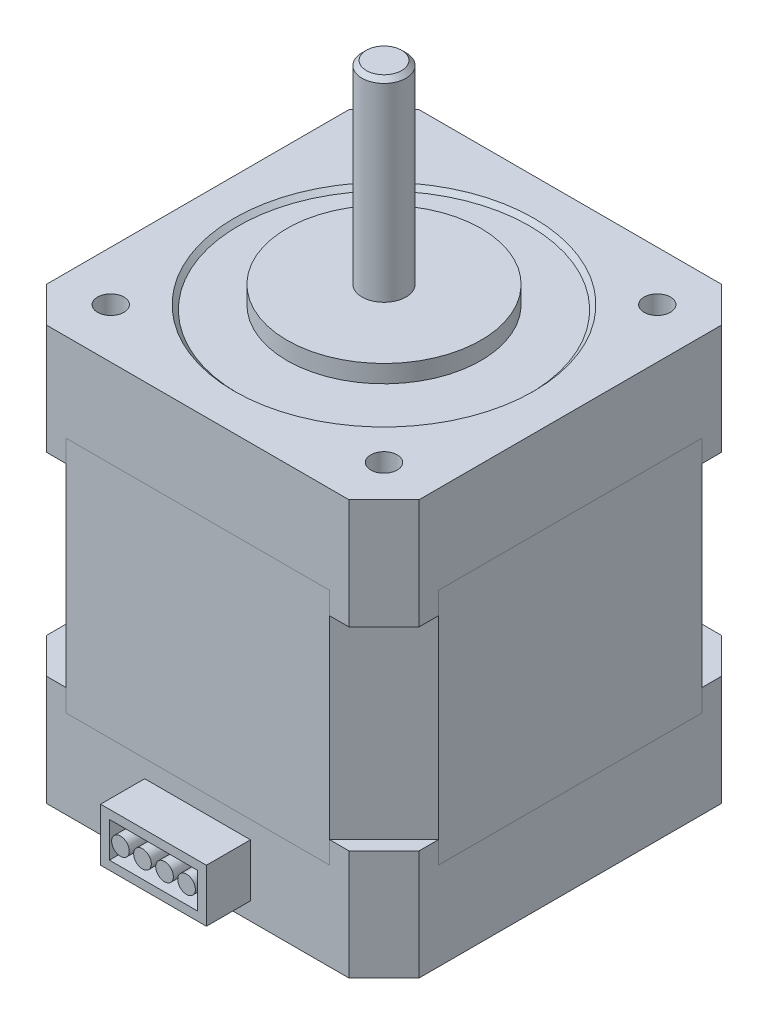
ISO-10303-21;
HEADER;
FILE_DESCRIPTION(('STEP AP214'),'2;1');
FILE_NAME('part.step','',(''),(''),'','','');
FILE_SCHEMA(('AUTOMOTIVE_DESIGN { 1 0 10303 214 1 1 1 1 }'));
ENDSEC;
DATA;
#1=APPLICATION_CONTEXT('core data for automotive mechanical design processes');
#2=APPLICATION_PROTOCOL_DEFINITION('international standard','automotive_design',2000,#1);
#3=PRODUCT_CONTEXT('',#1,'mechanical');
#4=PRODUCT('Part','Part','',(#3));
#5=PRODUCT_RELATED_PRODUCT_CATEGORY('part','',(#4));
#6=PRODUCT_DEFINITION_FORMATION('','',#4);
#7=PRODUCT_DEFINITION_CONTEXT('part definition',#1,'design');
#8=PRODUCT_DEFINITION('design','',#6,#7);
#9=PRODUCT_DEFINITION_SHAPE('','',#8);
#10=(LENGTH_UNIT() NAMED_UNIT(*) SI_UNIT(.MILLI.,.METRE.));
#11=(NAMED_UNIT(*) PLANE_ANGLE_UNIT() SI_UNIT($,.RADIAN.));
#12=(NAMED_UNIT(*) SI_UNIT($,.STERADIAN.) SOLID_ANGLE_UNIT());
#13=UNCERTAINTY_MEASURE_WITH_UNIT(LENGTH_MEASURE(1.E-05),#10,'distance_accuracy_value','');
#14=(GEOMETRIC_REPRESENTATION_CONTEXT(3) GLOBAL_UNCERTAINTY_ASSIGNED_CONTEXT((#13)) GLOBAL_UNIT_ASSIGNED_CONTEXT((#10,
#11,#12)) REPRESENTATION_CONTEXT('',''));
#15=CARTESIAN_POINT('',(0.,0.,0.));
#16=DIRECTION('',(0.,0.,1.));
#17=DIRECTION('',(1.,0.,0.));
#18=AXIS2_PLACEMENT_3D('',#15,#16,#17);
#19=CARTESIAN_POINT('',(0.,71.,0.));
#20=DIRECTION('',(0.,-1.,0.));
#21=DIRECTION('',(0.,0.,-1.));
#22=AXIS2_PLACEMENT_3D('',#19,#20,#21);
#23=CYLINDRICAL_SURFACE('',#22,2.5);
#24=CARTESIAN_POINT('',(0.,70.5,0.));
#25=DIRECTION('',(0.,1.,0.));
#26=DIRECTION('',(0.,0.,1.));
#27=AXIS2_PLACEMENT_3D('',#24,#25,#26);
#28=CIRCLE('',#27,2.5);
#29=CARTESIAN_POINT('',(0.,70.5,2.5));
#30=VERTEX_POINT('',#29);
#31=EDGE_CURVE('E11',#30,#30,#28,.F.);
#32=ORIENTED_EDGE('',*,*,#31,.T.);
#33=EDGE_LOOP('',(#32));
#34=FACE_BOUND('',#33,.T.);
#35=CARTESIAN_POINT('',(0.,49.,0.));
#36=DIRECTION('',(0.,1.,0.));
#37=DIRECTION('',(0.,0.,1.));
#38=AXIS2_PLACEMENT_3D('',#35,#36,#37);
#39=CIRCLE('',#38,2.5);
#40=CARTESIAN_POINT('',(0.,49.,2.5));
#41=VERTEX_POINT('',#40);
#42=EDGE_CURVE('E65',#41,#41,#39,.T.);
#43=ORIENTED_EDGE('',*,*,#42,.T.);
#44=EDGE_LOOP('',(#43));
#45=FACE_BOUND('',#44,.T.);
#46=ADVANCED_FACE('F51',(#34,#45),#23,.T.);
#47=CARTESIAN_POINT('',(0.,71.,0.));
#48=DIRECTION('',(0.,1.,0.));
#49=DIRECTION('',(0.,0.,1.));
#50=AXIS2_PLACEMENT_3D('',#47,#48,#49);
#51=PLANE('',#50);
#52=CARTESIAN_POINT('',(0.,71.,0.));
#53=DIRECTION('',(0.,1.,0.));
#54=DIRECTION('',(0.,0.,1.));
#55=AXIS2_PLACEMENT_3D('',#52,#53,#54);
#56=CIRCLE('',#55,2.00000000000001);
#57=CARTESIAN_POINT('',(0.,71.,2.00000000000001));
#58=VERTEX_POINT('',#57);
#59=EDGE_CURVE('E60',#58,#58,#56,.T.);
#60=ORIENTED_EDGE('',*,*,#59,.T.);
#61=EDGE_LOOP('',(#60));
#62=FACE_BOUND('',#61,.T.);
#63=ADVANCED_FACE('F76',(#62),#51,.T.);
#64=CARTESIAN_POINT('',(0.,49.,0.));
#65=DIRECTION('',(0.,1.,0.));
#66=DIRECTION('',(0.,0.,1.));
#67=AXIS2_PLACEMENT_3D('',#64,#65,#66);
#68=PLANE('',#67);
#69=ORIENTED_EDGE('',*,*,#42,.F.);
#70=EDGE_LOOP('',(#69));
#71=FACE_BOUND('',#70,.T.);
#72=ADVANCED_FACE('F74',(#71),#68,.F.);
#73=CARTESIAN_POINT('',(0.,71.,0.));
#74=DIRECTION('',(0.,-1.,0.));
#75=DIRECTION('',(0.,0.,-1.));
#76=AXIS2_PLACEMENT_3D('',#73,#74,#75);
#77=CONICAL_SURFACE('',#76,2.00000000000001,0.785398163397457);
#78=ORIENTED_EDGE('',*,*,#31,.F.);
#79=EDGE_LOOP('',(#78));
#80=FACE_BOUND('',#79,.T.);
#81=ORIENTED_EDGE('',*,*,#59,.F.);
#82=EDGE_LOOP('',(#81));
#83=FACE_BOUND('',#82,.T.);
#84=ADVANCED_FACE('F54',(#80,#83),#77,.T.);
#85=CLOSED_SHELL('',(#46,#63,#72,#84));
#86=MANIFOLD_SOLID_BREP('B2',#85);
#87=CARTESIAN_POINT('',(0.,49.,0.));
#88=DIRECTION('',(0.,-1.,0.));
#89=DIRECTION('',(0.,0.,-1.));
#90=AXIS2_PLACEMENT_3D('',#87,#88,#89);
#91=CYLINDRICAL_SURFACE('',#90,11.);
#92=CARTESIAN_POINT('',(0.,49.,0.));
#93=DIRECTION('',(0.,1.,0.));
#94=DIRECTION('',(0.,0.,1.));
#95=AXIS2_PLACEMENT_3D('',#92,#93,#94);
#96=CIRCLE('',#95,11.);
#97=CARTESIAN_POINT('',(0.,49.,11.));
#98=VERTEX_POINT('',#97);
#99=EDGE_CURVE('E50',#98,#98,#96,.T.);
#100=ORIENTED_EDGE('',*,*,#99,.F.);
#101=EDGE_LOOP('',(#100));
#102=FACE_BOUND('',#101,.T.);
#103=CARTESIAN_POINT('',(0.,47.,0.));
#104=DIRECTION('',(0.,1.,0.));
#105=DIRECTION('',(0.,0.,1.));
#106=AXIS2_PLACEMENT_3D('',#103,#104,#105);
#107=CIRCLE('',#106,11.);
#108=CARTESIAN_POINT('',(0.,47.,11.));
#109=VERTEX_POINT('',#108);
#110=EDGE_CURVE('E129',#109,#109,#107,.T.);
#111=ORIENTED_EDGE('',*,*,#110,.T.);
#112=EDGE_LOOP('',(#111));
#113=FACE_BOUND('',#112,.T.);
#114=ADVANCED_FACE('F126',(#102,#113),#91,.T.);
#115=CARTESIAN_POINT('',(0.,49.,0.));
#116=DIRECTION('',(0.,1.,0.));
#117=DIRECTION('',(0.,0.,1.));
#118=AXIS2_PLACEMENT_3D('',#115,#116,#117);
#119=PLANE('',#118);
#120=ORIENTED_EDGE('',*,*,#99,.T.);
#121=EDGE_LOOP('',(#120));
#122=FACE_BOUND('',#121,.T.);
#123=ADVANCED_FACE('F143',(#122),#119,.T.);
#124=CARTESIAN_POINT('',(0.,47.,0.));
#125=DIRECTION('',(0.,1.,0.));
#126=DIRECTION('',(0.,0.,1.));
#127=AXIS2_PLACEMENT_3D('',#124,#125,#126);
#128=PLANE('',#127);
#129=ORIENTED_EDGE('',*,*,#110,.F.);
#130=EDGE_LOOP('',(#129));
#131=FACE_BOUND('',#130,.T.);
#132=ADVANCED_FACE('F141',(#131),#128,.F.);
#133=CLOSED_SHELL('',(#114,#123,#132));
#134=MANIFOLD_SOLID_BREP('B6',#133);
#135=CARTESIAN_POINT('',(0.,37.,0.));
#136=DIRECTION('',(0.,-1.,0.));
#137=DIRECTION('',(0.,0.,-1.));
#138=AXIS2_PLACEMENT_3D('',#135,#136,#137);
#139=PLANE('',#138);
#140=DIRECTION('',(1.,0.,0.));
#141=VECTOR('',#140,1.);
#142=CARTESIAN_POINT('',(-17.1574984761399,37.,-21.15));
#143=LINE('',#142,#141);
#144=CARTESIAN_POINT('',(-14.946774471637,37.,-21.15));
#145=VERTEX_POINT('',#144);
#146=CARTESIAN_POINT('',(14.9467744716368,37.,-21.150000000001));
#147=VERTEX_POINT('',#146);
#148=EDGE_CURVE('E263',#145,#147,#143,.T.);
#149=ORIENTED_EDGE('',*,*,#148,.F.);
#150=DIRECTION('',(-0.707106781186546,0.,0.707106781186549));
#151=VECTOR('',#150,1.);
#152=CARTESIAN_POINT('',(-14.946774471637,37.,-21.15));
#153=LINE('',#152,#151);
#154=CARTESIAN_POINT('',(-21.15,37.,-14.946774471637));
#155=VERTEX_POINT('',#154);
#156=EDGE_CURVE('E185',#145,#155,#153,.T.);
#157=ORIENTED_EDGE('',*,*,#156,.T.);
#158=DIRECTION('',(0.,0.,-1.));
#159=VECTOR('',#158,1.);
#160=CARTESIAN_POINT('',(-21.15,37.,17.1574984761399));
#161=LINE('',#160,#159);
#162=CARTESIAN_POINT('',(-21.15,37.,14.9467744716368));
#163=VERTEX_POINT('',#162);
#164=EDGE_CURVE('E249',#163,#155,#161,.T.);
#165=ORIENTED_EDGE('',*,*,#164,.F.);
#166=DIRECTION('',(0.707106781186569,0.,0.707106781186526));
#167=VECTOR('',#166,1.);
#168=CARTESIAN_POINT('',(-21.149999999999,37.,14.9467744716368));
#169=LINE('',#168,#167);
#170=CARTESIAN_POINT('',(-14.9467744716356,37.,21.1499999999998));
#171=VERTEX_POINT('',#170);
#172=EDGE_CURVE('E259',#163,#171,#169,.T.);
#173=ORIENTED_EDGE('',*,*,#172,.T.);
#174=DIRECTION('',(-1.,0.,0.));
#175=VECTOR('',#174,1.);
#176=CARTESIAN_POINT('',(17.1574984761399,37.,21.15));
#177=LINE('',#176,#175);
#178=CARTESIAN_POINT('',(14.9467744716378,37.,21.15));
#179=VERTEX_POINT('',#178);
#180=EDGE_CURVE('E258',#179,#171,#177,.T.);
#181=ORIENTED_EDGE('',*,*,#180,.F.);
#182=DIRECTION('',(0.707106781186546,0.,-0.707106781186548));
#183=VECTOR('',#182,1.);
#184=CARTESIAN_POINT('',(14.9467744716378,37.,21.1499999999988));
#185=LINE('',#184,#183);
#186=CARTESIAN_POINT('',(21.15,37.,14.9467744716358));
#187=VERTEX_POINT('',#186);
#188=EDGE_CURVE('E286',#179,#187,#185,.T.);
#189=ORIENTED_EDGE('',*,*,#188,.T.);
#190=DIRECTION('',(0.,0.,1.));
#191=VECTOR('',#190,1.);
#192=CARTESIAN_POINT('',(21.15,37.,-17.1574984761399));
#193=LINE('',#192,#191);
#194=CARTESIAN_POINT('',(21.15,37.,-14.946774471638));
#195=VERTEX_POINT('',#194);
#196=EDGE_CURVE('E293',#195,#187,#193,.T.);
#197=ORIENTED_EDGE('',*,*,#196,.F.);
#198=DIRECTION('',(-0.707106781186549,0.,-0.707106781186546));
#199=VECTOR('',#198,1.);
#200=CARTESIAN_POINT('',(21.1499999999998,37.,-14.946774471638));
#201=LINE('',#200,#199);
#202=EDGE_CURVE('E267',#195,#147,#201,.T.);
#203=ORIENTED_EDGE('',*,*,#202,.T.);
#204=EDGE_LOOP('',(#149,#157,#165,#173,#181,#189,#197,#203));
#205=FACE_BOUND('',#204,.T.);
#206=ADVANCED_FACE('F181',(#205),#139,.F.);
#207=CARTESIAN_POINT('',(-14.9467744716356,47.002,21.1499999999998));
#208=DIRECTION('',(0.,0.,-1.));
#209=DIRECTION('',(-1.,0.,0.));
#210=AXIS2_PLACEMENT_3D('',#207,#208,#209);
#211=PLANE('',#210);
#212=DIRECTION('',(0.,-1.,0.));
#213=VECTOR('',#212,1.);
#214=CARTESIAN_POINT('',(14.9467744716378,47.002,21.15));
#215=LINE('',#214,#213);
#216=CARTESIAN_POINT('',(14.9467744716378,10.,21.15));
#217=VERTEX_POINT('',#216);
#218=EDGE_CURVE('E314',#179,#217,#215,.T.);
#219=ORIENTED_EDGE('',*,*,#218,.F.);
#220=ORIENTED_EDGE('',*,*,#180,.T.);
#221=DIRECTION('',(0.,-1.,0.));
#222=VECTOR('',#221,1.);
#223=CARTESIAN_POINT('',(-14.9467744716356,47.002,21.1499999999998));
#224=LINE('',#223,#222);
#225=CARTESIAN_POINT('',(-14.9467744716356,10.,21.1499999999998));
#226=VERTEX_POINT('',#225);
#227=EDGE_CURVE('E207',#171,#226,#224,.T.);
#228=ORIENTED_EDGE('',*,*,#227,.T.);
#229=DIRECTION('',(1.,0.,0.));
#230=VECTOR('',#229,1.);
#231=CARTESIAN_POINT('',(-14.9467744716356,10.,21.1499999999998));
#232=LINE('',#231,#230);
#233=EDGE_CURVE('E322',#226,#217,#232,.T.);
#234=ORIENTED_EDGE('',*,*,#233,.T.);
#235=EDGE_LOOP('',(#219,#220,#228,#234));
#236=FACE_BOUND('',#235,.T.);
#237=ADVANCED_FACE('F340',(#236),#211,.F.);
#238=CARTESIAN_POINT('',(14.9467744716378,47.002,21.15));
#239=DIRECTION('',(-0.707106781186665,0.,-0.70710678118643));
#240=DIRECTION('',(-0.70710678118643,0.,0.707106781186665));
#241=AXIS2_PLACEMENT_3D('',#238,#239,#240);
#242=PLANE('',#241);
#243=DIRECTION('',(0.70710678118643,0.,-0.707106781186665));
#244=VECTOR('',#243,1.);
#245=CARTESIAN_POINT('',(14.9467744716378,10.,21.15));
#246=LINE('',#245,#244);
#247=CARTESIAN_POINT('',(21.15,10.,14.9467744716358));
#248=VERTEX_POINT('',#247);
#249=EDGE_CURVE('E324',#217,#248,#246,.T.);
#250=ORIENTED_EDGE('',*,*,#249,.T.);
#251=DIRECTION('',(0.,-1.,0.));
#252=VECTOR('',#251,1.);
#253=CARTESIAN_POINT('',(21.15,47.002,14.9467744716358));
#254=LINE('',#253,#252);
#255=EDGE_CURVE('E309',#187,#248,#254,.T.);
#256=ORIENTED_EDGE('',*,*,#255,.F.);
#257=ORIENTED_EDGE('',*,*,#188,.F.);
#258=ORIENTED_EDGE('',*,*,#218,.T.);
#259=EDGE_LOOP('',(#250,#256,#257,#258));
#260=FACE_BOUND('',#259,.T.);
#261=ADVANCED_FACE('F349',(#260),#242,.F.);
#262=CARTESIAN_POINT('',(21.15,47.002,14.9467744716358));
#263=DIRECTION('',(-1.,0.,0.));
#264=DIRECTION('',(0.,0.,1.));
#265=AXIS2_PLACEMENT_3D('',#262,#263,#264);
#266=PLANE('',#265);
#267=DIRECTION('',(0.,-1.,0.));
#268=VECTOR('',#267,1.);
#269=CARTESIAN_POINT('',(21.15,47.002,-14.946774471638));
#270=LINE('',#269,#268);
#271=CARTESIAN_POINT('',(21.15,10.,-14.946774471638));
#272=VERTEX_POINT('',#271);
#273=EDGE_CURVE('E307',#195,#272,#270,.T.);
#274=ORIENTED_EDGE('',*,*,#273,.F.);
#275=ORIENTED_EDGE('',*,*,#196,.T.);
#276=ORIENTED_EDGE('',*,*,#255,.T.);
#277=DIRECTION('',(0.,0.,-1.));
#278=VECTOR('',#277,1.);
#279=CARTESIAN_POINT('',(21.15,10.,14.9467744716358));
#280=LINE('',#279,#278);
#281=EDGE_CURVE('E328',#248,#272,#280,.T.);
#282=ORIENTED_EDGE('',*,*,#281,.T.);
#283=EDGE_LOOP('',(#274,#275,#276,#282));
#284=FACE_BOUND('',#283,.T.);
#285=ADVANCED_FACE('F351',(#284),#266,.F.);
#286=CARTESIAN_POINT('',(-21.15,47.002,14.9467744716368));
#287=DIRECTION('',(0.707106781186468,0.,-0.707106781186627));
#288=DIRECTION('',(-0.707106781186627,0.,-0.707106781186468));
#289=AXIS2_PLACEMENT_3D('',#286,#287,#288);
#290=PLANE('',#289);
#291=DIRECTION('',(0.707106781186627,0.,0.707106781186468));
#292=VECTOR('',#291,1.);
#293=CARTESIAN_POINT('',(-21.15,10.,14.9467744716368));
#294=LINE('',#293,#292);
#295=CARTESIAN_POINT('',(-21.15,10.,14.9467744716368));
#296=VERTEX_POINT('',#295);
#297=EDGE_CURVE('E191',#296,#226,#294,.T.);
#298=ORIENTED_EDGE('',*,*,#297,.T.);
#299=ORIENTED_EDGE('',*,*,#227,.F.);
#300=ORIENTED_EDGE('',*,*,#172,.F.);
#301=DIRECTION('',(0.,-1.,0.));
#302=VECTOR('',#301,1.);
#303=CARTESIAN_POINT('',(-21.15,47.002,14.9467744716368));
#304=LINE('',#303,#302);
#305=EDGE_CURVE('E199',#163,#296,#304,.T.);
#306=ORIENTED_EDGE('',*,*,#305,.T.);
#307=EDGE_LOOP('',(#298,#299,#300,#306));
#308=FACE_BOUND('',#307,.T.);
#309=ADVANCED_FACE('F341',(#308),#290,.F.);
#310=CARTESIAN_POINT('',(21.15,47.002,-14.946774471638));
#311=DIRECTION('',(-0.707106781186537,0.,0.707106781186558));
#312=DIRECTION('',(0.707106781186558,0.,0.707106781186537));
#313=AXIS2_PLACEMENT_3D('',#310,#311,#312);
#314=PLANE('',#313);
#315=DIRECTION('',(-0.707106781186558,0.,-0.707106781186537));
#316=VECTOR('',#315,1.);
#317=CARTESIAN_POINT('',(21.15,10.,-14.946774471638));
#318=LINE('',#317,#316);
#319=CARTESIAN_POINT('',(14.9467744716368,10.,-21.150000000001));
#320=VERTEX_POINT('',#319);
#321=EDGE_CURVE('E305',#272,#320,#318,.T.);
#322=ORIENTED_EDGE('',*,*,#321,.T.);
#323=DIRECTION('',(0.,-1.,0.));
#324=VECTOR('',#323,1.);
#325=CARTESIAN_POINT('',(14.9467744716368,47.002,-21.150000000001));
#326=LINE('',#325,#324);
#327=EDGE_CURVE('E280',#147,#320,#326,.T.);
#328=ORIENTED_EDGE('',*,*,#327,.F.);
#329=ORIENTED_EDGE('',*,*,#202,.F.);
#330=ORIENTED_EDGE('',*,*,#273,.T.);
#331=EDGE_LOOP('',(#322,#328,#329,#330));
#332=FACE_BOUND('',#331,.T.);
#333=ADVANCED_FACE('F303',(#332),#314,.F.);
#334=CARTESIAN_POINT('',(-21.15,47.002,-14.946774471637));
#335=DIRECTION('',(1.,0.,0.));
#336=DIRECTION('',(0.,0.,-1.));
#337=AXIS2_PLACEMENT_3D('',#334,#335,#336);
#338=PLANE('',#337);
#339=ORIENTED_EDGE('',*,*,#305,.F.);
#340=ORIENTED_EDGE('',*,*,#164,.T.);
#341=DIRECTION('',(0.,-1.,0.));
#342=VECTOR('',#341,1.);
#343=CARTESIAN_POINT('',(-21.15,47.002,-14.946774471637));
#344=LINE('',#343,#342);
#345=CARTESIAN_POINT('',(-21.15,10.,-14.946774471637));
#346=VERTEX_POINT('',#345);
#347=EDGE_CURVE('E253',#155,#346,#344,.T.);
#348=ORIENTED_EDGE('',*,*,#347,.T.);
#349=DIRECTION('',(0.,0.,1.));
#350=VECTOR('',#349,1.);
#351=CARTESIAN_POINT('',(-21.15,10.,-14.946774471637));
#352=LINE('',#351,#350);
#353=EDGE_CURVE('E124',#346,#296,#352,.T.);
#354=ORIENTED_EDGE('',*,*,#353,.T.);
#355=EDGE_LOOP('',(#339,#340,#348,#354));
#356=FACE_BOUND('',#355,.T.);
#357=ADVANCED_FACE('F251',(#356),#338,.F.);
#358=CARTESIAN_POINT('',(0.,10.,0.));
#359=DIRECTION('',(0.,1.,0.));
#360=DIRECTION('',(0.,0.,1.));
#361=AXIS2_PLACEMENT_3D('',#358,#359,#360);
#362=PLANE('',#361);
#363=ORIENTED_EDGE('',*,*,#353,.F.);
#364=DIRECTION('',(-0.707106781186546,0.,0.707106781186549));
#365=VECTOR('',#364,1.);
#366=CARTESIAN_POINT('',(-14.946774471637,10.,-21.15));
#367=LINE('',#366,#365);
#368=CARTESIAN_POINT('',(-14.946774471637,10.,-21.15));
#369=VERTEX_POINT('',#368);
#370=EDGE_CURVE('E269',#369,#346,#367,.T.);
#371=ORIENTED_EDGE('',*,*,#370,.F.);
#372=DIRECTION('',(-1.,0.,0.));
#373=VECTOR('',#372,1.);
#374=CARTESIAN_POINT('',(14.9467744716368,10.,-21.150000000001));
#375=LINE('',#374,#373);
#376=EDGE_CURVE('E277',#320,#369,#375,.T.);
#377=ORIENTED_EDGE('',*,*,#376,.F.);
#378=ORIENTED_EDGE('',*,*,#321,.F.);
#379=ORIENTED_EDGE('',*,*,#281,.F.);
#380=ORIENTED_EDGE('',*,*,#249,.F.);
#381=ORIENTED_EDGE('',*,*,#233,.F.);
#382=ORIENTED_EDGE('',*,*,#297,.F.);
#383=EDGE_LOOP('',(#363,#371,#377,#378,#379,#380,#381,#382));
#384=FACE_BOUND('',#383,.T.);
#385=ADVANCED_FACE('F345',(#384),#362,.F.);
#386=CARTESIAN_POINT('',(14.9467744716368,47.002,-21.150000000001));
#387=DIRECTION('',(0.,0.,1.));
#388=DIRECTION('',(1.,0.,0.));
#389=AXIS2_PLACEMENT_3D('',#386,#387,#388);
#390=PLANE('',#389);
#391=DIRECTION('',(0.,-1.,0.));
#392=VECTOR('',#391,1.);
#393=CARTESIAN_POINT('',(-14.946774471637,47.002,-21.15));
#394=LINE('',#393,#392);
#395=EDGE_CURVE('E272',#145,#369,#394,.T.);
#396=ORIENTED_EDGE('',*,*,#395,.F.);
#397=ORIENTED_EDGE('',*,*,#148,.T.);
#398=ORIENTED_EDGE('',*,*,#327,.T.);
#399=ORIENTED_EDGE('',*,*,#376,.T.);
#400=EDGE_LOOP('',(#396,#397,#398,#399));
#401=FACE_BOUND('',#400,.T.);
#402=ADVANCED_FACE('F298',(#401),#390,.F.);
#403=CARTESIAN_POINT('',(-14.946774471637,47.002,-21.15));
#404=DIRECTION('',(0.707106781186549,0.,0.707106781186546));
#405=DIRECTION('',(0.707106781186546,0.,-0.707106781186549));
#406=AXIS2_PLACEMENT_3D('',#403,#404,#405);
#407=PLANE('',#406);
#408=ORIENTED_EDGE('',*,*,#370,.T.);
#409=ORIENTED_EDGE('',*,*,#347,.F.);
#410=ORIENTED_EDGE('',*,*,#156,.F.);
#411=ORIENTED_EDGE('',*,*,#395,.T.);
#412=EDGE_LOOP('',(#408,#409,#410,#411));
#413=FACE_BOUND('',#412,.T.);
#414=ADVANCED_FACE('F183',(#413),#407,.F.);
#415=CLOSED_SHELL('',(#206,#237,#261,#285,#309,#333,#357,#385,#402,#414));
#416=MANIFOLD_SOLID_BREP('B45',#415);
#417=CARTESIAN_POINT('',(0.,37.,0.));
#418=DIRECTION('',(0.,-1.,0.));
#419=DIRECTION('',(0.,0.,-1.));
#420=AXIS2_PLACEMENT_3D('',#417,#418,#419);
#421=PLANE('',#420);
#422=DIRECTION('',(1.,0.,0.));
#423=VECTOR('',#422,1.);
#424=CARTESIAN_POINT('',(-17.1574984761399,37.,-21.15));
#425=LINE('',#424,#423);
#426=CARTESIAN_POINT('',(-14.946774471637,37.,-21.15));
#427=VERTEX_POINT('',#426);
#428=CARTESIAN_POINT('',(14.9467744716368,37.,-21.15));
#429=VERTEX_POINT('',#428);
#430=EDGE_CURVE('E468',#427,#429,#425,.T.);
#431=ORIENTED_EDGE('',*,*,#430,.T.);
#432=DIRECTION('',(-0.707106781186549,0.,-0.707106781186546));
#433=VECTOR('',#432,1.);
#434=CARTESIAN_POINT('',(21.1499999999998,37.,-14.946774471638));
#435=LINE('',#434,#433);
#436=CARTESIAN_POINT('',(21.1499999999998,37.,-14.946774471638));
#437=VERTEX_POINT('',#436);
#438=EDGE_CURVE('E595',#437,#429,#435,.T.);
#439=ORIENTED_EDGE('',*,*,#438,.F.);
#440=DIRECTION('',(0.,0.,1.));
#441=VECTOR('',#440,1.);
#442=CARTESIAN_POINT('',(21.15,37.,-17.1574984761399));
#443=LINE('',#442,#441);
#444=CARTESIAN_POINT('',(21.15,37.,14.9467744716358));
#445=VERTEX_POINT('',#444);
#446=EDGE_CURVE('E474',#437,#445,#443,.T.);
#447=ORIENTED_EDGE('',*,*,#446,.T.);
#448=DIRECTION('',(0.707106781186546,0.,-0.707106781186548));
#449=VECTOR('',#448,1.);
#450=CARTESIAN_POINT('',(14.9467744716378,37.,21.1499999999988));
#451=LINE('',#450,#449);
#452=CARTESIAN_POINT('',(14.9467744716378,37.,21.1499999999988));
#453=VERTEX_POINT('',#452);
#454=EDGE_CURVE('E616',#453,#445,#451,.T.);
#455=ORIENTED_EDGE('',*,*,#454,.F.);
#456=DIRECTION('',(-1.,0.,0.));
#457=VECTOR('',#456,1.);
#458=CARTESIAN_POINT('',(17.1574984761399,37.,21.15));
#459=LINE('',#458,#457);
#460=CARTESIAN_POINT('',(-14.9467744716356,37.,21.15));
#461=VERTEX_POINT('',#460);
#462=EDGE_CURVE('E705',#453,#461,#459,.T.);
#463=ORIENTED_EDGE('',*,*,#462,.T.);
#464=DIRECTION('',(0.707106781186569,0.,0.707106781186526));
#465=VECTOR('',#464,1.);
#466=CARTESIAN_POINT('',(-21.149999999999,37.,14.9467744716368));
#467=LINE('',#466,#465);
#468=CARTESIAN_POINT('',(-21.15,37.,14.9467744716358));
#469=VERTEX_POINT('',#468);
#470=EDGE_CURVE('E642',#469,#461,#467,.T.);
#471=ORIENTED_EDGE('',*,*,#470,.F.);
#472=DIRECTION('',(0.,0.,-1.));
#473=VECTOR('',#472,1.);
#474=CARTESIAN_POINT('',(-21.15,37.,17.1574984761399));
#475=LINE('',#474,#473);
#476=CARTESIAN_POINT('',(-21.15,37.,-14.946774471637));
#477=VERTEX_POINT('',#476);
#478=EDGE_CURVE('E697',#469,#477,#475,.T.);
#479=ORIENTED_EDGE('',*,*,#478,.T.);
#480=DIRECTION('',(-0.707106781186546,0.,0.707106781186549));
#481=VECTOR('',#480,1.);
#482=CARTESIAN_POINT('',(-14.946774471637,37.,-21.15));
#483=LINE('',#482,#481);
#484=EDGE_CURVE('E669',#427,#477,#483,.T.);
#485=ORIENTED_EDGE('',*,*,#484,.F.);
#486=EDGE_LOOP('',(#431,#439,#447,#455,#463,#471,#479,#485));
#487=FACE_BOUND('',#486,.T.);
#488=ADVANCED_FACE('F451',(#487),#421,.T.);
#489=CARTESIAN_POINT('',(-17.1574984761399,37.,21.15));
#490=DIRECTION('',(0.707106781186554,0.,-0.707106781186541));
#491=DIRECTION('',(-0.707106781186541,0.,-0.707106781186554));
#492=AXIS2_PLACEMENT_3D('',#489,#490,#491);
#493=PLANE('',#492);
#494=DIRECTION('',(-0.707106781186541,0.,-0.707106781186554));
#495=VECTOR('',#494,1.);
#496=CARTESIAN_POINT('',(-17.1574984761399,47.,21.15));
#497=LINE('',#496,#495);
#498=CARTESIAN_POINT('',(-17.1574984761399,47.,21.15));
#499=VERTEX_POINT('',#498);
#500=CARTESIAN_POINT('',(-21.15,47.,17.1574984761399));
#501=VERTEX_POINT('',#500);
#502=EDGE_CURVE('E696',#499,#501,#497,.T.);
#503=ORIENTED_EDGE('',*,*,#502,.T.);
#504=DIRECTION('',(0.,1.,0.));
#505=VECTOR('',#504,1.);
#506=CARTESIAN_POINT('',(-21.15,37.,17.1574984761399));
#507=LINE('',#506,#505);
#508=CARTESIAN_POINT('',(-21.149999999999,34.5,17.1574984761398));
#509=VERTEX_POINT('',#508);
#510=EDGE_CURVE('E749',#509,#501,#507,.T.);
#511=ORIENTED_EDGE('',*,*,#510,.F.);
#512=DIRECTION('',(-0.707106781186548,0.,-0.707106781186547));
#513=VECTOR('',#512,1.);
#514=CARTESIAN_POINT('',(-17.1574984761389,34.5,21.1499999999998));
#515=LINE('',#514,#513);
#516=CARTESIAN_POINT('',(-17.1574984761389,34.5,21.1499999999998));
#517=VERTEX_POINT('',#516);
#518=EDGE_CURVE('E654',#517,#509,#515,.T.);
#519=ORIENTED_EDGE('',*,*,#518,.F.);
#520=DIRECTION('',(0.,1.,0.));
#521=VECTOR('',#520,1.);
#522=CARTESIAN_POINT('',(-17.1574984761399,37.,21.15));
#523=LINE('',#522,#521);
#524=EDGE_CURVE('E708',#517,#499,#523,.T.);
#525=ORIENTED_EDGE('',*,*,#524,.T.);
#526=EDGE_LOOP('',(#503,#511,#519,#525));
#527=FACE_BOUND('',#526,.T.);
#528=ADVANCED_FACE('F775',(#527),#493,.F.);
#529=CARTESIAN_POINT('',(-21.15,37.,17.1574984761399));
#530=DIRECTION('',(1.,0.,0.));
#531=DIRECTION('',(0.,0.,-1.));
#532=AXIS2_PLACEMENT_3D('',#529,#530,#531);
#533=PLANE('',#532);
#534=DIRECTION('',(0.,0.,-1.));
#535=VECTOR('',#534,1.);
#536=CARTESIAN_POINT('',(-21.15,47.,17.1574984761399));
#537=LINE('',#536,#535);
#538=CARTESIAN_POINT('',(-21.15,47.,-17.1574984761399));
#539=VERTEX_POINT('',#538);
#540=EDGE_CURVE('E712',#501,#539,#537,.T.);
#541=ORIENTED_EDGE('',*,*,#540,.T.);
#542=DIRECTION('',(0.,1.,0.));
#543=VECTOR('',#542,1.);
#544=CARTESIAN_POINT('',(-21.15,37.,-17.1574984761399));
#545=LINE('',#544,#543);
#546=CARTESIAN_POINT('',(-21.15,34.5,-17.1574984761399));
#547=VERTEX_POINT('',#546);
#548=EDGE_CURVE('E746',#547,#539,#545,.T.);
#549=ORIENTED_EDGE('',*,*,#548,.F.);
#550=DIRECTION('',(0.,0.,-1.));
#551=VECTOR('',#550,1.);
#552=CARTESIAN_POINT('',(-21.15,34.5,-14.946774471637));
#553=LINE('',#552,#551);
#554=CARTESIAN_POINT('',(-21.15,34.5,-14.946774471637));
#555=VERTEX_POINT('',#554);
#556=EDGE_CURVE('E677',#555,#547,#553,.T.);
#557=ORIENTED_EDGE('',*,*,#556,.F.);
#558=DIRECTION('',(0.,1.,0.));
#559=VECTOR('',#558,1.);
#560=CARTESIAN_POINT('',(-21.15,34.5,-14.946774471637));
#561=LINE('',#560,#559);
#562=EDGE_CURVE('E685',#555,#477,#561,.T.);
#563=ORIENTED_EDGE('',*,*,#562,.T.);
#564=ORIENTED_EDGE('',*,*,#478,.F.);
#565=DIRECTION('',(0.,1.,0.));
#566=VECTOR('',#565,1.);
#567=CARTESIAN_POINT('',(-21.149999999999,34.5,14.9467744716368));
#568=LINE('',#567,#566);
#569=CARTESIAN_POINT('',(-21.149999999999,34.5,14.9467744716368));
#570=VERTEX_POINT('',#569);
#571=EDGE_CURVE('E665',#570,#469,#568,.T.);
#572=ORIENTED_EDGE('',*,*,#571,.F.);
#573=DIRECTION('',(0.,0.,-1.));
#574=VECTOR('',#573,1.);
#575=CARTESIAN_POINT('',(-21.149999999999,34.5,17.1574984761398));
#576=LINE('',#575,#574);
#577=EDGE_CURVE('E643',#509,#570,#576,.T.);
#578=ORIENTED_EDGE('',*,*,#577,.F.);
#579=ORIENTED_EDGE('',*,*,#510,.T.);
#580=EDGE_LOOP('',(#541,#549,#557,#563,#564,#572,#578,#579));
#581=FACE_BOUND('',#580,.T.);
#582=ADVANCED_FACE('F780',(#581),#533,.F.);
#583=CARTESIAN_POINT('',(-21.15,37.,-17.1574984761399));
#584=DIRECTION('',(0.707106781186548,0.,0.707106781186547));
#585=DIRECTION('',(0.707106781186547,0.,-0.707106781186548));
#586=AXIS2_PLACEMENT_3D('',#583,#584,#585);
#587=PLANE('',#586);
#588=DIRECTION('',(0.707106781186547,0.,-0.707106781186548));
#589=VECTOR('',#588,1.);
#590=CARTESIAN_POINT('',(-21.15,47.,-17.1574984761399));
#591=LINE('',#590,#589);
#592=CARTESIAN_POINT('',(-17.1574984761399,47.,-21.15));
#593=VERTEX_POINT('',#592);
#594=EDGE_CURVE('E715',#539,#593,#591,.T.);
#595=ORIENTED_EDGE('',*,*,#594,.T.);
#596=DIRECTION('',(0.,1.,0.));
#597=VECTOR('',#596,1.);
#598=CARTESIAN_POINT('',(-17.1574984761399,37.,-21.15));
#599=LINE('',#598,#597);
#600=CARTESIAN_POINT('',(-17.1574984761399,34.5,-21.15));
#601=VERTEX_POINT('',#600);
#602=EDGE_CURVE('E578',#601,#593,#599,.T.);
#603=ORIENTED_EDGE('',*,*,#602,.F.);
#604=DIRECTION('',(0.707106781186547,0.,-0.707106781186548));
#605=VECTOR('',#604,1.);
#606=CARTESIAN_POINT('',(-21.15,34.5,-17.1574984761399));
#607=LINE('',#606,#605);
#608=EDGE_CURVE('E681',#547,#601,#607,.T.);
#609=ORIENTED_EDGE('',*,*,#608,.F.);
#610=ORIENTED_EDGE('',*,*,#548,.T.);
#611=EDGE_LOOP('',(#595,#603,#609,#610));
#612=FACE_BOUND('',#611,.T.);
#613=ADVANCED_FACE('F804',(#612),#587,.F.);
#614=CARTESIAN_POINT('',(-17.1574984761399,37.,-21.15));
#615=DIRECTION('',(0.,0.,1.));
#616=DIRECTION('',(1.,0.,0.));
#617=AXIS2_PLACEMENT_3D('',#614,#615,#616);
#618=PLANE('',#617);
#619=DIRECTION('',(1.,0.,0.));
#620=VECTOR('',#619,1.);
#621=CARTESIAN_POINT('',(-17.1574984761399,47.,-21.15));
#622=LINE('',#621,#620);
#623=CARTESIAN_POINT('',(17.1574984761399,47.,-21.15));
#624=VERTEX_POINT('',#623);
#625=EDGE_CURVE('E574',#593,#624,#622,.T.);
#626=ORIENTED_EDGE('',*,*,#625,.T.);
#627=DIRECTION('',(0.,1.,0.));
#628=VECTOR('',#627,1.);
#629=CARTESIAN_POINT('',(17.1574984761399,37.,-21.15));
#630=LINE('',#629,#628);
#631=CARTESIAN_POINT('',(17.1574984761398,34.5,-21.150000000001));
#632=VERTEX_POINT('',#631);
#633=EDGE_CURVE('E566',#632,#624,#630,.T.);
#634=ORIENTED_EDGE('',*,*,#633,.F.);
#635=DIRECTION('',(1.,0.,0.));
#636=VECTOR('',#635,1.);
#637=CARTESIAN_POINT('',(14.9467744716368,34.5,-21.150000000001));
#638=LINE('',#637,#636);
#639=CARTESIAN_POINT('',(14.9467744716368,34.5,-21.150000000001));
#640=VERTEX_POINT('',#639);
#641=EDGE_CURVE('E571',#640,#632,#638,.T.);
#642=ORIENTED_EDGE('',*,*,#641,.F.);
#643=DIRECTION('',(0.,1.,0.));
#644=VECTOR('',#643,1.);
#645=CARTESIAN_POINT('',(14.9467744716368,34.5,-21.150000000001));
#646=LINE('',#645,#644);
#647=EDGE_CURVE('E609',#640,#429,#646,.T.);
#648=ORIENTED_EDGE('',*,*,#647,.T.);
#649=ORIENTED_EDGE('',*,*,#430,.F.);
#650=DIRECTION('',(0.,1.,0.));
#651=VECTOR('',#650,1.);
#652=CARTESIAN_POINT('',(-14.946774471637,34.5,-21.15));
#653=LINE('',#652,#651);
#654=CARTESIAN_POINT('',(-14.946774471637,34.5,-21.15));
#655=VERTEX_POINT('',#654);
#656=EDGE_CURVE('E692',#655,#427,#653,.T.);
#657=ORIENTED_EDGE('',*,*,#656,.F.);
#658=DIRECTION('',(1.,0.,0.));
#659=VECTOR('',#658,1.);
#660=CARTESIAN_POINT('',(-17.1574984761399,34.5,-21.15));
#661=LINE('',#660,#659);
#662=EDGE_CURVE('E670',#601,#655,#661,.T.);
#663=ORIENTED_EDGE('',*,*,#662,.F.);
#664=ORIENTED_EDGE('',*,*,#602,.T.);
#665=EDGE_LOOP('',(#626,#634,#642,#648,#649,#657,#663,#664));
#666=FACE_BOUND('',#665,.T.);
#667=ADVANCED_FACE('F568',(#666),#618,.F.);
#668=CARTESIAN_POINT('',(17.1574984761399,37.,-21.15));
#669=DIRECTION('',(-0.707106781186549,0.,0.707106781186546));
#670=DIRECTION('',(0.707106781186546,0.,0.707106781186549));
#671=AXIS2_PLACEMENT_3D('',#668,#669,#670);
#672=PLANE('',#671);
#673=DIRECTION('',(0.707106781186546,0.,0.707106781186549));
#674=VECTOR('',#673,1.);
#675=CARTESIAN_POINT('',(17.1574984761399,47.,-21.15));
#676=LINE('',#675,#674);
#677=CARTESIAN_POINT('',(21.15,47.,-17.1574984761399));
#678=VERTEX_POINT('',#677);
#679=EDGE_CURVE('E720',#624,#678,#676,.T.);
#680=ORIENTED_EDGE('',*,*,#679,.T.);
#681=DIRECTION('',(0.,1.,0.));
#682=VECTOR('',#681,1.);
#683=CARTESIAN_POINT('',(21.15,37.,-17.1574984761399));
#684=LINE('',#683,#682);
#685=CARTESIAN_POINT('',(21.1499999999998,34.5,-17.1574984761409));
#686=VERTEX_POINT('',#685);
#687=EDGE_CURVE('E579',#686,#678,#684,.T.);
#688=ORIENTED_EDGE('',*,*,#687,.F.);
#689=DIRECTION('',(0.707106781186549,0.,0.707106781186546));
#690=VECTOR('',#689,1.);
#691=CARTESIAN_POINT('',(17.1574984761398,34.5,-21.150000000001));
#692=LINE('',#691,#690);
#693=EDGE_CURVE('E582',#632,#686,#692,.T.);
#694=ORIENTED_EDGE('',*,*,#693,.F.);
#695=ORIENTED_EDGE('',*,*,#633,.T.);
#696=EDGE_LOOP('',(#680,#688,#694,#695));
#697=FACE_BOUND('',#696,.T.);
#698=ADVANCED_FACE('F583',(#697),#672,.F.);
#699=CARTESIAN_POINT('',(21.15,37.,-17.1574984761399));
#700=DIRECTION('',(-1.,0.,0.));
#701=DIRECTION('',(0.,0.,1.));
#702=AXIS2_PLACEMENT_3D('',#699,#700,#701);
#703=PLANE('',#702);
#704=DIRECTION('',(0.,0.,1.));
#705=VECTOR('',#704,1.);
#706=CARTESIAN_POINT('',(21.15,47.,-17.1574984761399));
#707=LINE('',#706,#705);
#708=CARTESIAN_POINT('',(21.15,47.,17.1574984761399));
#709=VERTEX_POINT('',#708);
#710=EDGE_CURVE('E723',#678,#709,#707,.T.);
#711=ORIENTED_EDGE('',*,*,#710,.T.);
#712=DIRECTION('',(0.,1.,0.));
#713=VECTOR('',#712,1.);
#714=CARTESIAN_POINT('',(21.15,37.,17.1574984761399));
#715=LINE('',#714,#713);
#716=CARTESIAN_POINT('',(21.1500000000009,34.5,17.1574984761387));
#717=VERTEX_POINT('',#716);
#718=EDGE_CURVE('E738',#717,#709,#715,.T.);
#719=ORIENTED_EDGE('',*,*,#718,.F.);
#720=DIRECTION('',(0.,0.,1.));
#721=VECTOR('',#720,1.);
#722=CARTESIAN_POINT('',(21.1500000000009,34.5,14.9467744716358));
#723=LINE('',#722,#721);
#724=CARTESIAN_POINT('',(21.1500000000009,34.5,14.9467744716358));
#725=VERTEX_POINT('',#724);
#726=EDGE_CURVE('E624',#725,#717,#723,.T.);
#727=ORIENTED_EDGE('',*,*,#726,.F.);
#728=DIRECTION('',(0.,1.,0.));
#729=VECTOR('',#728,1.);
#730=CARTESIAN_POINT('',(21.1500000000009,34.5,14.9467744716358));
#731=LINE('',#730,#729);
#732=EDGE_CURVE('E632',#725,#445,#731,.T.);
#733=ORIENTED_EDGE('',*,*,#732,.T.);
#734=ORIENTED_EDGE('',*,*,#446,.F.);
#735=DIRECTION('',(0.,1.,0.));
#736=VECTOR('',#735,1.);
#737=CARTESIAN_POINT('',(21.1499999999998,34.5,-14.946774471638));
#738=LINE('',#737,#736);
#739=CARTESIAN_POINT('',(21.1499999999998,34.5,-14.946774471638));
#740=VERTEX_POINT('',#739);
#741=EDGE_CURVE('E612',#740,#437,#738,.T.);
#742=ORIENTED_EDGE('',*,*,#741,.F.);
#743=DIRECTION('',(0.,0.,1.));
#744=VECTOR('',#743,1.);
#745=CARTESIAN_POINT('',(21.1499999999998,34.5,-17.1574984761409));
#746=LINE('',#745,#744);
#747=EDGE_CURVE('E588',#686,#740,#746,.T.);
#748=ORIENTED_EDGE('',*,*,#747,.F.);
#749=ORIENTED_EDGE('',*,*,#687,.T.);
#750=EDGE_LOOP('',(#711,#719,#727,#733,#734,#742,#748,#749));
#751=FACE_BOUND('',#750,.T.);
#752=ADVANCED_FACE('F795',(#751),#703,.F.);
#753=CARTESIAN_POINT('',(21.15,37.,17.1574984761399));
#754=DIRECTION('',(-0.707106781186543,0.,-0.707106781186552));
#755=DIRECTION('',(-0.707106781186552,0.,0.707106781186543));
#756=AXIS2_PLACEMENT_3D('',#753,#754,#755);
#757=PLANE('',#756);
#758=DIRECTION('',(-0.707106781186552,0.,0.707106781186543));
#759=VECTOR('',#758,1.);
#760=CARTESIAN_POINT('',(21.15,47.,17.1574984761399));
#761=LINE('',#760,#759);
#762=CARTESIAN_POINT('',(17.1574984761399,47.,21.15));
#763=VERTEX_POINT('',#762);
#764=EDGE_CURVE('E726',#709,#763,#761,.T.);
#765=ORIENTED_EDGE('',*,*,#764,.T.);
#766=DIRECTION('',(0.,1.,0.));
#767=VECTOR('',#766,1.);
#768=CARTESIAN_POINT('',(17.1574984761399,37.,21.15));
#769=LINE('',#768,#767);
#770=CARTESIAN_POINT('',(17.1574984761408,34.5,21.1499999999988));
#771=VERTEX_POINT('',#770);
#772=EDGE_CURVE('E734',#771,#763,#769,.T.);
#773=ORIENTED_EDGE('',*,*,#772,.F.);
#774=DIRECTION('',(-0.707106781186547,0.,0.707106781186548));
#775=VECTOR('',#774,1.);
#776=CARTESIAN_POINT('',(21.1500000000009,34.5,17.1574984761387));
#777=LINE('',#776,#775);
#778=EDGE_CURVE('E628',#717,#771,#777,.T.);
#779=ORIENTED_EDGE('',*,*,#778,.F.);
#780=ORIENTED_EDGE('',*,*,#718,.T.);
#781=EDGE_LOOP('',(#765,#773,#779,#780));
#782=FACE_BOUND('',#781,.T.);
#783=ADVANCED_FACE('F791',(#782),#757,.F.);
#784=CARTESIAN_POINT('',(17.1574984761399,37.,21.15));
#785=DIRECTION('',(0.,0.,-1.));
#786=DIRECTION('',(-1.,0.,0.));
#787=AXIS2_PLACEMENT_3D('',#784,#785,#786);
#788=PLANE('',#787);
#789=DIRECTION('',(-1.,0.,0.));
#790=VECTOR('',#789,1.);
#791=CARTESIAN_POINT('',(17.1574984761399,47.,21.15));
#792=LINE('',#791,#790);
#793=EDGE_CURVE('E700',#763,#499,#792,.T.);
#794=ORIENTED_EDGE('',*,*,#793,.T.);
#795=ORIENTED_EDGE('',*,*,#524,.F.);
#796=DIRECTION('',(-1.,0.,0.));
#797=VECTOR('',#796,1.);
#798=CARTESIAN_POINT('',(-14.9467744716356,34.5,21.1499999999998));
#799=LINE('',#798,#797);
#800=CARTESIAN_POINT('',(-14.9467744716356,34.5,21.1499999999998));
#801=VERTEX_POINT('',#800);
#802=EDGE_CURVE('E650',#801,#517,#799,.T.);
#803=ORIENTED_EDGE('',*,*,#802,.F.);
#804=DIRECTION('',(0.,1.,0.));
#805=VECTOR('',#804,1.);
#806=CARTESIAN_POINT('',(-14.9467744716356,34.5,21.1499999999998));
#807=LINE('',#806,#805);
#808=EDGE_CURVE('E658',#801,#461,#807,.T.);
#809=ORIENTED_EDGE('',*,*,#808,.T.);
#810=ORIENTED_EDGE('',*,*,#462,.F.);
#811=DIRECTION('',(0.,1.,0.));
#812=VECTOR('',#811,1.);
#813=CARTESIAN_POINT('',(14.9467744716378,34.5,21.1499999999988));
#814=LINE('',#813,#812);
#815=CARTESIAN_POINT('',(14.9467744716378,34.5,21.1499999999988));
#816=VERTEX_POINT('',#815);
#817=EDGE_CURVE('E638',#816,#453,#814,.T.);
#818=ORIENTED_EDGE('',*,*,#817,.F.);
#819=DIRECTION('',(-1.,0.,0.));
#820=VECTOR('',#819,1.);
#821=CARTESIAN_POINT('',(17.1574984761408,34.5,21.1499999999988));
#822=LINE('',#821,#820);
#823=EDGE_CURVE('E617',#771,#816,#822,.T.);
#824=ORIENTED_EDGE('',*,*,#823,.F.);
#825=ORIENTED_EDGE('',*,*,#772,.T.);
#826=EDGE_LOOP('',(#794,#795,#803,#809,#810,#818,#824,#825));
#827=FACE_BOUND('',#826,.T.);
#828=ADVANCED_FACE('F788',(#827),#788,.F.);
#829=CARTESIAN_POINT('',(0.,47.,0.));
#830=DIRECTION('',(0.,-1.,0.));
#831=DIRECTION('',(0.,0.,-1.));
#832=AXIS2_PLACEMENT_3D('',#829,#830,#831);
#833=PLANE('',#832);
#834=CARTESIAN_POINT('',(0.,47.,0.));
#835=DIRECTION('',(0.,-1.,0.));
#836=DIRECTION('',(0.,0.,-1.));
#837=AXIS2_PLACEMENT_3D('',#834,#835,#836);
#838=CIRCLE('',#837,17.);
#839=CARTESIAN_POINT('',(0.,47.,-17.));
#840=VERTEX_POINT('',#839);
#841=EDGE_CURVE('E461',#840,#840,#838,.T.);
#842=ORIENTED_EDGE('',*,*,#841,.T.);
#843=EDGE_LOOP('',(#842));
#844=FACE_BOUND('',#843,.T.);
#845=CARTESIAN_POINT('',(-15.4999999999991,47.,15.5));
#846=DIRECTION('',(0.,1.,0.));
#847=DIRECTION('',(0.,0.,1.));
#848=AXIS2_PLACEMENT_3D('',#845,#846,#847);
#849=CIRCLE('',#848,1.50000000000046);
#850=CARTESIAN_POINT('',(-15.4999999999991,47.,17.0000000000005));
#851=VERTEX_POINT('',#850);
#852=EDGE_CURVE('E1156',#851,#851,#849,.T.);
#853=ORIENTED_EDGE('',*,*,#852,.F.);
#854=EDGE_LOOP('',(#853));
#855=FACE_BOUND('',#854,.T.);
#856=CARTESIAN_POINT('',(15.5000000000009,47.,15.4999999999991));
#857=DIRECTION('',(0.,1.,0.));
#858=DIRECTION('',(0.,0.,1.));
#859=AXIS2_PLACEMENT_3D('',#856,#857,#858);
#860=CIRCLE('',#859,1.50000000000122);
#861=CARTESIAN_POINT('',(15.5000000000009,47.,17.0000000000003));
#862=VERTEX_POINT('',#861);
#863=EDGE_CURVE('E1160',#862,#862,#860,.T.);
#864=ORIENTED_EDGE('',*,*,#863,.F.);
#865=EDGE_LOOP('',(#864));
#866=FACE_BOUND('',#865,.T.);
#867=CARTESIAN_POINT('',(15.5,47.,-15.5000000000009));
#868=DIRECTION('',(0.,1.,0.));
#869=DIRECTION('',(0.,0.,1.));
#870=AXIS2_PLACEMENT_3D('',#867,#868,#869);
#871=CIRCLE('',#870,1.5000000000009);
#872=CARTESIAN_POINT('',(15.5,47.,-14.));
#873=VERTEX_POINT('',#872);
#874=EDGE_CURVE('E1173',#873,#873,#871,.T.);
#875=ORIENTED_EDGE('',*,*,#874,.F.);
#876=EDGE_LOOP('',(#875));
#877=FACE_BOUND('',#876,.T.);
#878=CARTESIAN_POINT('',(-15.5,47.,-15.5));
#879=DIRECTION('',(0.,1.,0.));
#880=DIRECTION('',(0.,0.,1.));
#881=AXIS2_PLACEMENT_3D('',#878,#879,#880);
#882=CIRCLE('',#881,1.5);
#883=CARTESIAN_POINT('',(-15.5,47.,-14.));
#884=VERTEX_POINT('',#883);
#885=EDGE_CURVE('E603',#884,#884,#882,.T.);
#886=ORIENTED_EDGE('',*,*,#885,.F.);
#887=EDGE_LOOP('',(#886));
#888=FACE_BOUND('',#887,.T.);
#889=ORIENTED_EDGE('',*,*,#502,.F.);
#890=ORIENTED_EDGE('',*,*,#793,.F.);
#891=ORIENTED_EDGE('',*,*,#764,.F.);
#892=ORIENTED_EDGE('',*,*,#710,.F.);
#893=ORIENTED_EDGE('',*,*,#679,.F.);
#894=ORIENTED_EDGE('',*,*,#625,.F.);
#895=ORIENTED_EDGE('',*,*,#594,.F.);
#896=ORIENTED_EDGE('',*,*,#540,.F.);
#897=EDGE_LOOP('',(#889,#890,#891,#892,#893,#894,#895,#896));
#898=FACE_BOUND('',#897,.T.);
#899=ADVANCED_FACE('F756',(#844,#855,#866,#877,#888,#898),#833,.F.);
#900=CARTESIAN_POINT('',(-14.946774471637,34.5,-21.15));
#901=DIRECTION('',(-0.707106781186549,0.,-0.707106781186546));
#902=DIRECTION('',(-0.707106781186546,0.,0.707106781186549));
#903=AXIS2_PLACEMENT_3D('',#900,#901,#902);
#904=PLANE('',#903);
#905=ORIENTED_EDGE('',*,*,#484,.T.);
#906=ORIENTED_EDGE('',*,*,#562,.F.);
#907=DIRECTION('',(-0.707106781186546,0.,0.707106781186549));
#908=VECTOR('',#907,1.);
#909=CARTESIAN_POINT('',(-14.946774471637,34.5,-21.15));
#910=LINE('',#909,#908);
#911=EDGE_CURVE('E674',#655,#555,#910,.T.);
#912=ORIENTED_EDGE('',*,*,#911,.F.);
#913=ORIENTED_EDGE('',*,*,#656,.T.);
#914=EDGE_LOOP('',(#905,#906,#912,#913));
#915=FACE_BOUND('',#914,.T.);
#916=ADVANCED_FACE('F784',(#915),#904,.F.);
#917=CARTESIAN_POINT('',(0.,34.5,0.));
#918=DIRECTION('',(0.,1.,0.));
#919=DIRECTION('',(0.,0.,1.));
#920=AXIS2_PLACEMENT_3D('',#917,#918,#919);
#921=PLANE('',#920);
#922=ORIENTED_EDGE('',*,*,#662,.T.);
#923=ORIENTED_EDGE('',*,*,#911,.T.);
#924=ORIENTED_EDGE('',*,*,#556,.T.);
#925=ORIENTED_EDGE('',*,*,#608,.T.);
#926=EDGE_LOOP('',(#922,#923,#924,#925));
#927=FACE_BOUND('',#926,.T.);
#928=ADVANCED_FACE('F828',(#927),#921,.F.);
#929=CARTESIAN_POINT('',(-21.149999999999,34.5,14.9467744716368));
#930=DIRECTION('',(-0.707106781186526,0.,0.707106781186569));
#931=DIRECTION('',(0.707106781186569,0.,0.707106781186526));
#932=AXIS2_PLACEMENT_3D('',#929,#930,#931);
#933=PLANE('',#932);
#934=ORIENTED_EDGE('',*,*,#470,.T.);
#935=ORIENTED_EDGE('',*,*,#808,.F.);
#936=DIRECTION('',(0.707106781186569,0.,0.707106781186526));
#937=VECTOR('',#936,1.);
#938=CARTESIAN_POINT('',(-21.149999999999,34.5,14.9467744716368));
#939=LINE('',#938,#937);
#940=EDGE_CURVE('E647',#570,#801,#939,.T.);
#941=ORIENTED_EDGE('',*,*,#940,.F.);
#942=ORIENTED_EDGE('',*,*,#571,.T.);
#943=EDGE_LOOP('',(#934,#935,#941,#942));
#944=FACE_BOUND('',#943,.T.);
#945=ADVANCED_FACE('F832',(#944),#933,.F.);
#946=CARTESIAN_POINT('',(0.,34.5,0.));
#947=DIRECTION('',(0.,1.,0.));
#948=DIRECTION('',(0.,0.,1.));
#949=AXIS2_PLACEMENT_3D('',#946,#947,#948);
#950=PLANE('',#949);
#951=ORIENTED_EDGE('',*,*,#577,.T.);
#952=ORIENTED_EDGE('',*,*,#940,.T.);
#953=ORIENTED_EDGE('',*,*,#802,.T.);
#954=ORIENTED_EDGE('',*,*,#518,.T.);
#955=EDGE_LOOP('',(#951,#952,#953,#954));
#956=FACE_BOUND('',#955,.T.);
#957=ADVANCED_FACE('F836',(#956),#950,.F.);
#958=CARTESIAN_POINT('',(14.9467744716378,34.5,21.1499999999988));
#959=DIRECTION('',(0.707106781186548,0.,0.707106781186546));
#960=DIRECTION('',(0.707106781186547,0.,-0.707106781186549));
#961=AXIS2_PLACEMENT_3D('',#958,#959,#960);
#962=PLANE('',#961);
#963=ORIENTED_EDGE('',*,*,#454,.T.);
#964=ORIENTED_EDGE('',*,*,#732,.F.);
#965=DIRECTION('',(0.707106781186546,0.,-0.707106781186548));
#966=VECTOR('',#965,1.);
#967=CARTESIAN_POINT('',(14.9467744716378,34.5,21.1499999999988));
#968=LINE('',#967,#966);
#969=EDGE_CURVE('E621',#816,#725,#968,.T.);
#970=ORIENTED_EDGE('',*,*,#969,.F.);
#971=ORIENTED_EDGE('',*,*,#817,.T.);
#972=EDGE_LOOP('',(#963,#964,#970,#971));
#973=FACE_BOUND('',#972,.T.);
#974=ADVANCED_FACE('F847',(#973),#962,.F.);
#975=CARTESIAN_POINT('',(0.,34.5,0.));
#976=DIRECTION('',(0.,1.,0.));
#977=DIRECTION('',(0.,0.,1.));
#978=AXIS2_PLACEMENT_3D('',#975,#976,#977);
#979=PLANE('',#978);
#980=ORIENTED_EDGE('',*,*,#823,.T.);
#981=ORIENTED_EDGE('',*,*,#969,.T.);
#982=ORIENTED_EDGE('',*,*,#726,.T.);
#983=ORIENTED_EDGE('',*,*,#778,.T.);
#984=EDGE_LOOP('',(#980,#981,#982,#983));
#985=FACE_BOUND('',#984,.T.);
#986=ADVANCED_FACE('F843',(#985),#979,.F.);
#987=CARTESIAN_POINT('',(21.1499999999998,34.5,-14.946774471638));
#988=DIRECTION('',(0.707106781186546,0.,-0.707106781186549));
#989=DIRECTION('',(-0.707106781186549,0.,-0.707106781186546));
#990=AXIS2_PLACEMENT_3D('',#987,#988,#989);
#991=PLANE('',#990);
#992=ORIENTED_EDGE('',*,*,#438,.T.);
#993=ORIENTED_EDGE('',*,*,#647,.F.);
#994=DIRECTION('',(-0.707106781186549,0.,-0.707106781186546));
#995=VECTOR('',#994,1.);
#996=CARTESIAN_POINT('',(21.1499999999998,34.5,-14.946774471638));
#997=LINE('',#996,#995);
#998=EDGE_CURVE('E592',#740,#640,#997,.T.);
#999=ORIENTED_EDGE('',*,*,#998,.F.);
#1000=ORIENTED_EDGE('',*,*,#741,.T.);
#1001=EDGE_LOOP('',(#992,#993,#999,#1000));
#1002=FACE_BOUND('',#1001,.T.);
#1003=ADVANCED_FACE('F822',(#1002),#991,.F.);
#1004=CARTESIAN_POINT('',(0.,34.5,0.));
#1005=DIRECTION('',(0.,-1.,0.));
#1006=DIRECTION('',(0.,0.,-1.));
#1007=AXIS2_PLACEMENT_3D('',#1004,#1005,#1006);
#1008=PLANE('',#1007);
#1009=ORIENTED_EDGE('',*,*,#641,.T.);
#1010=ORIENTED_EDGE('',*,*,#693,.T.);
#1011=ORIENTED_EDGE('',*,*,#747,.T.);
#1012=ORIENTED_EDGE('',*,*,#998,.T.);
#1013=EDGE_LOOP('',(#1009,#1010,#1011,#1012));
#1014=FACE_BOUND('',#1013,.T.);
#1015=ADVANCED_FACE('F590',(#1014),#1008,.T.);
#1016=CARTESIAN_POINT('',(-15.5,42.,-15.5));
#1017=DIRECTION('',(0.,1.,0.));
#1018=DIRECTION('',(0.,0.,1.));
#1019=AXIS2_PLACEMENT_3D('',#1016,#1017,#1018);
#1020=CYLINDRICAL_SURFACE('',#1019,1.5);
#1021=CARTESIAN_POINT('',(-15.5,42.,-15.5));
#1022=DIRECTION('',(0.,1.,0.));
#1023=DIRECTION('',(0.,0.,1.));
#1024=AXIS2_PLACEMENT_3D('',#1021,#1022,#1023);
#1025=CIRCLE('',#1024,1.5);
#1026=CARTESIAN_POINT('',(-15.5,42.,-14.));
#1027=VERTEX_POINT('',#1026);
#1028=EDGE_CURVE('E600',#1027,#1027,#1025,.T.);
#1029=ORIENTED_EDGE('',*,*,#1028,.F.);
#1030=EDGE_LOOP('',(#1029));
#1031=FACE_BOUND('',#1030,.T.);
#1032=ORIENTED_EDGE('',*,*,#885,.T.);
#1033=EDGE_LOOP('',(#1032));
#1034=FACE_BOUND('',#1033,.T.);
#1035=ADVANCED_FACE('F1006',(#1031,#1034),#1020,.F.);
#1036=CARTESIAN_POINT('',(-15.5,42.,-15.5));
#1037=DIRECTION('',(0.,1.,0.));
#1038=DIRECTION('',(0.,0.,1.));
#1039=AXIS2_PLACEMENT_3D('',#1036,#1037,#1038);
#1040=PLANE('',#1039);
#1041=ORIENTED_EDGE('',*,*,#1028,.T.);
#1042=EDGE_LOOP('',(#1041));
#1043=FACE_BOUND('',#1042,.T.);
#1044=ADVANCED_FACE('F1016',(#1043),#1040,.T.);
#1045=CARTESIAN_POINT('',(15.5,42.,-15.5000000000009));
#1046=DIRECTION('',(0.,1.,0.));
#1047=DIRECTION('',(0.,0.,1.));
#1048=AXIS2_PLACEMENT_3D('',#1045,#1046,#1047);
#1049=CYLINDRICAL_SURFACE('',#1048,1.5000000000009);
#1050=CARTESIAN_POINT('',(15.5,42.,-15.5000000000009));
#1051=DIRECTION('',(0.,1.,0.));
#1052=DIRECTION('',(0.,0.,1.));
#1053=AXIS2_PLACEMENT_3D('',#1050,#1051,#1052);
#1054=CIRCLE('',#1053,1.5000000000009);
#1055=CARTESIAN_POINT('',(15.5,42.,-14.));
#1056=VERTEX_POINT('',#1055);
#1057=EDGE_CURVE('E1168',#1056,#1056,#1054,.T.);
#1058=ORIENTED_EDGE('',*,*,#1057,.F.);
#1059=EDGE_LOOP('',(#1058));
#1060=FACE_BOUND('',#1059,.T.);
#1061=ORIENTED_EDGE('',*,*,#874,.T.);
#1062=EDGE_LOOP('',(#1061));
#1063=FACE_BOUND('',#1062,.T.);
#1064=ADVANCED_FACE('F1030',(#1060,#1063),#1049,.F.);
#1065=CARTESIAN_POINT('',(15.5,42.,-15.5000000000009));
#1066=DIRECTION('',(0.,1.,0.));
#1067=DIRECTION('',(0.,0.,1.));
#1068=AXIS2_PLACEMENT_3D('',#1065,#1066,#1067);
#1069=PLANE('',#1068);
#1070=ORIENTED_EDGE('',*,*,#1057,.T.);
#1071=EDGE_LOOP('',(#1070));
#1072=FACE_BOUND('',#1071,.T.);
#1073=ADVANCED_FACE('F1040',(#1072),#1069,.T.);
#1074=CARTESIAN_POINT('',(15.5000000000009,42.,15.4999999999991));
#1075=DIRECTION('',(0.,1.,0.));
#1076=DIRECTION('',(0.,0.,1.));
#1077=AXIS2_PLACEMENT_3D('',#1074,#1075,#1076);
#1078=CYLINDRICAL_SURFACE('',#1077,1.50000000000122);
#1079=CARTESIAN_POINT('',(15.5000000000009,42.,15.4999999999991));
#1080=DIRECTION('',(0.,1.,0.));
#1081=DIRECTION('',(0.,0.,1.));
#1082=AXIS2_PLACEMENT_3D('',#1079,#1080,#1081);
#1083=CIRCLE('',#1082,1.50000000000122);
#1084=CARTESIAN_POINT('',(15.5000000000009,42.,17.0000000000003));
#1085=VERTEX_POINT('',#1084);
#1086=EDGE_CURVE('E1179',#1085,#1085,#1083,.T.);
#1087=ORIENTED_EDGE('',*,*,#1086,.F.);
#1088=EDGE_LOOP('',(#1087));
#1089=FACE_BOUND('',#1088,.T.);
#1090=ORIENTED_EDGE('',*,*,#863,.T.);
#1091=EDGE_LOOP('',(#1090));
#1092=FACE_BOUND('',#1091,.T.);
#1093=ADVANCED_FACE('F1052',(#1089,#1092),#1078,.F.);
#1094=CARTESIAN_POINT('',(15.5000000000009,42.,15.4999999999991));
#1095=DIRECTION('',(0.,1.,0.));
#1096=DIRECTION('',(0.,0.,1.));
#1097=AXIS2_PLACEMENT_3D('',#1094,#1095,#1096);
#1098=PLANE('',#1097);
#1099=ORIENTED_EDGE('',*,*,#1086,.T.);
#1100=EDGE_LOOP('',(#1099));
#1101=FACE_BOUND('',#1100,.T.);
#1102=ADVANCED_FACE('F1061',(#1101),#1098,.T.);
#1103=CARTESIAN_POINT('',(-15.4999999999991,42.,15.5));
#1104=DIRECTION('',(0.,1.,0.));
#1105=DIRECTION('',(0.,0.,1.));
#1106=AXIS2_PLACEMENT_3D('',#1103,#1104,#1105);
#1107=CYLINDRICAL_SURFACE('',#1106,1.50000000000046);
#1108=CARTESIAN_POINT('',(-15.4999999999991,42.,15.5));
#1109=DIRECTION('',(0.,1.,0.));
#1110=DIRECTION('',(0.,0.,1.));
#1111=AXIS2_PLACEMENT_3D('',#1108,#1109,#1110);
#1112=CIRCLE('',#1111,1.50000000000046);
#1113=CARTESIAN_POINT('',(-15.4999999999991,42.,17.0000000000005));
#1114=VERTEX_POINT('',#1113);
#1115=EDGE_CURVE('E1153',#1114,#1114,#1112,.T.);
#1116=ORIENTED_EDGE('',*,*,#1115,.F.);
#1117=EDGE_LOOP('',(#1116));
#1118=FACE_BOUND('',#1117,.T.);
#1119=ORIENTED_EDGE('',*,*,#852,.T.);
#1120=EDGE_LOOP('',(#1119));
#1121=FACE_BOUND('',#1120,.T.);
#1122=ADVANCED_FACE('F770',(#1118,#1121),#1107,.F.);
#1123=CARTESIAN_POINT('',(-15.4999999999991,42.,15.5));
#1124=DIRECTION('',(0.,1.,0.));
#1125=DIRECTION('',(0.,0.,1.));
#1126=AXIS2_PLACEMENT_3D('',#1123,#1124,#1125);
#1127=PLANE('',#1126);
#1128=ORIENTED_EDGE('',*,*,#1115,.T.);
#1129=EDGE_LOOP('',(#1128));
#1130=FACE_BOUND('',#1129,.T.);
#1131=ADVANCED_FACE('F765',(#1130),#1127,.T.);
#1132=CARTESIAN_POINT('',(0.,46.5,0.));
#1133=DIRECTION('',(0.,1.,0.));
#1134=DIRECTION('',(0.,0.,1.));
#1135=AXIS2_PLACEMENT_3D('',#1132,#1133,#1134);
#1136=PLANE('',#1135);
#1137=CARTESIAN_POINT('',(0.,46.5,0.));
#1138=DIRECTION('',(0.,1.,0.));
#1139=DIRECTION('',(0.,0.,1.));
#1140=AXIS2_PLACEMENT_3D('',#1137,#1138,#1139);
#1141=CIRCLE('',#1140,16.5);
#1142=CARTESIAN_POINT('',(0.,46.5,16.5));
#1143=VERTEX_POINT('',#1142);
#1144=EDGE_CURVE('E179',#1143,#1143,#1141,.T.);
#1145=ORIENTED_EDGE('',*,*,#1144,.T.);
#1146=EDGE_LOOP('',(#1145));
#1147=FACE_BOUND('',#1146,.T.);
#1148=ADVANCED_FACE('F761',(#1147),#1136,.T.);
#1149=CARTESIAN_POINT('',(0.,45.,0.));
#1150=DIRECTION('',(0.,1.,0.));
#1151=DIRECTION('',(0.,0.,1.));
#1152=AXIS2_PLACEMENT_3D('',#1149,#1150,#1151);
#1153=CONICAL_SURFACE('',#1152,15.,0.785398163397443);
#1154=ORIENTED_EDGE('',*,*,#841,.F.);
#1155=EDGE_LOOP('',(#1154));
#1156=FACE_BOUND('',#1155,.T.);
#1157=ORIENTED_EDGE('',*,*,#1144,.F.);
#1158=EDGE_LOOP('',(#1157));
#1159=FACE_BOUND('',#1158,.T.);
#1160=ADVANCED_FACE('F454',(#1156,#1159),#1153,.F.);
#1161=CLOSED_SHELL('',(#488,#528,#582,#613,#667,#698,#752,#783,#828,#899,#916,#928,#945,#957,
#974,#986,#1003,#1015,#1035,#1044,#1064,#1073,#1093,#1102,#1122,#1131,#1148,#1160));
#1162=MANIFOLD_SOLID_BREP('B118',#1161);
#1163=CARTESIAN_POINT('',(-17.1574984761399,10.,21.15));
#1164=DIRECTION('',(0.,0.,-1.));
#1165=DIRECTION('',(-1.,0.,0.));
#1166=AXIS2_PLACEMENT_3D('',#1163,#1164,#1165);
#1167=PLANE('',#1166);
#1168=DIRECTION('',(1.,0.,0.));
#1169=VECTOR('',#1168,1.);
#1170=CARTESIAN_POINT('',(-17.1574984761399,0.,21.15));
#1171=LINE('',#1170,#1169);
#1172=CARTESIAN_POINT('',(-17.1574984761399,0.,21.15));
#1173=VERTEX_POINT('',#1172);
#1174=CARTESIAN_POINT('',(17.1574984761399,0.,21.15));
#1175=VERTEX_POINT('',#1174);
#1176=EDGE_CURVE('E1597',#1173,#1175,#1171,.T.);
#1177=ORIENTED_EDGE('',*,*,#1176,.T.);
#1178=DIRECTION('',(0.,-1.,0.));
#1179=VECTOR('',#1178,1.);
#1180=CARTESIAN_POINT('',(17.1574984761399,10.,21.15));
#1181=LINE('',#1180,#1179);
#1182=CARTESIAN_POINT('',(17.1574984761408,12.5,21.1499999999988));
#1183=VERTEX_POINT('',#1182);
#1184=EDGE_CURVE('E1606',#1183,#1175,#1181,.T.);
#1185=ORIENTED_EDGE('',*,*,#1184,.F.);
#1186=DIRECTION('',(1.,0.,0.));
#1187=VECTOR('',#1186,1.);
#1188=CARTESIAN_POINT('',(14.9467744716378,12.5,21.1499999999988));
#1189=LINE('',#1188,#1187);
#1190=CARTESIAN_POINT('',(14.9467744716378,12.5,21.1499999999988));
#1191=VERTEX_POINT('',#1190);
#1192=EDGE_CURVE('E1516',#1191,#1183,#1189,.T.);
#1193=ORIENTED_EDGE('',*,*,#1192,.F.);
#1194=DIRECTION('',(0.,-1.,0.));
#1195=VECTOR('',#1194,1.);
#1196=CARTESIAN_POINT('',(14.9467744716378,12.5,21.1499999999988));
#1197=LINE('',#1196,#1195);
#1198=CARTESIAN_POINT('',(14.9467744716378,10.,21.15));
#1199=VERTEX_POINT('',#1198);
#1200=EDGE_CURVE('E1530',#1191,#1199,#1197,.T.);
#1201=ORIENTED_EDGE('',*,*,#1200,.T.);
#1202=DIRECTION('',(1.,0.,0.));
#1203=VECTOR('',#1202,1.);
#1204=CARTESIAN_POINT('',(-17.1574984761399,10.,21.15));
#1205=LINE('',#1204,#1203);
#1206=CARTESIAN_POINT('',(-14.9467744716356,10.,21.1499999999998));
#1207=VERTEX_POINT('',#1206);
#1208=EDGE_CURVE('E1603',#1207,#1199,#1205,.T.);
#1209=ORIENTED_EDGE('',*,*,#1208,.F.);
#1210=DIRECTION('',(0.,-1.,0.));
#1211=VECTOR('',#1210,1.);
#1212=CARTESIAN_POINT('',(-14.9467744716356,12.5,21.1499999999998));
#1213=LINE('',#1212,#1211);
#1214=CARTESIAN_POINT('',(-14.9467744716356,12.5,21.1499999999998));
#1215=VERTEX_POINT('',#1214);
#1216=EDGE_CURVE('E1511',#1215,#1207,#1213,.T.);
#1217=ORIENTED_EDGE('',*,*,#1216,.F.);
#1218=DIRECTION('',(1.,0.,0.));
#1219=VECTOR('',#1218,1.);
#1220=CARTESIAN_POINT('',(-17.1574984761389,12.5,21.1499999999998));
#1221=LINE('',#1220,#1219);
#1222=CARTESIAN_POINT('',(-17.1574984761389,12.5,21.1499999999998));
#1223=VERTEX_POINT('',#1222);
#1224=EDGE_CURVE('E1498',#1223,#1215,#1221,.T.);
#1225=ORIENTED_EDGE('',*,*,#1224,.F.);
#1226=DIRECTION('',(0.,-1.,0.));
#1227=VECTOR('',#1226,1.);
#1228=CARTESIAN_POINT('',(-17.1574984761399,10.,21.15));
#1229=LINE('',#1228,#1227);
#1230=EDGE_CURVE('E1633',#1223,#1173,#1229,.T.);
#1231=ORIENTED_EDGE('',*,*,#1230,.T.);
#1232=EDGE_LOOP('',(#1177,#1185,#1193,#1201,#1209,#1217,#1225,#1231));
#1233=FACE_BOUND('',#1232,.T.);
#1234=DIRECTION('',(0.,-1.,0.));
#1235=VECTOR('',#1234,1.);
#1236=CARTESIAN_POINT('',(-6.,2.,21.15));
#1237=LINE('',#1236,#1235);
#1238=CARTESIAN_POINT('',(-6.,8.,21.15));
#1239=VERTEX_POINT('',#1238);
#1240=CARTESIAN_POINT('',(-6.,2.,21.15));
#1241=VERTEX_POINT('',#1240);
#1242=EDGE_CURVE('E1381',#1239,#1241,#1237,.T.);
#1243=ORIENTED_EDGE('',*,*,#1242,.F.);
#1244=DIRECTION('',(-1.,0.,0.));
#1245=VECTOR('',#1244,1.);
#1246=CARTESIAN_POINT('',(-6.,8.,21.15));
#1247=LINE('',#1246,#1245);
#1248=CARTESIAN_POINT('',(6.,8.,21.15));
#1249=VERTEX_POINT('',#1248);
#1250=EDGE_CURVE('E1423',#1249,#1239,#1247,.T.);
#1251=ORIENTED_EDGE('',*,*,#1250,.F.);
#1252=DIRECTION('',(0.,1.,0.));
#1253=VECTOR('',#1252,1.);
#1254=CARTESIAN_POINT('',(6.,2.,21.15));
#1255=LINE('',#1254,#1253);
#1256=CARTESIAN_POINT('',(6.,2.,21.15));
#1257=VERTEX_POINT('',#1256);
#1258=EDGE_CURVE('E1221',#1257,#1249,#1255,.T.);
#1259=ORIENTED_EDGE('',*,*,#1258,.F.);
#1260=DIRECTION('',(1.,0.,0.));
#1261=VECTOR('',#1260,1.);
#1262=CARTESIAN_POINT('',(-6.,2.,21.15));
#1263=LINE('',#1262,#1261);
#1264=EDGE_CURVE('E1216',#1241,#1257,#1263,.T.);
#1265=ORIENTED_EDGE('',*,*,#1264,.F.);
#1266=EDGE_LOOP('',(#1243,#1251,#1259,#1265));
#1267=FACE_BOUND('',#1266,.T.);
#1268=ADVANCED_FACE('F1200',(#1233,#1267),#1167,.F.);
#1269=CARTESIAN_POINT('',(0.,10.,0.));
#1270=DIRECTION('',(0.,-1.,0.));
#1271=DIRECTION('',(0.,0.,-1.));
#1272=AXIS2_PLACEMENT_3D('',#1269,#1270,#1271);
#1273=PLANE('',#1272);
#1274=DIRECTION('',(-0.707106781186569,0.,-0.707106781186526));
#1275=VECTOR('',#1274,1.);
#1276=CARTESIAN_POINT('',(-14.9467744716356,10.,21.1499999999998));
#1277=LINE('',#1276,#1275);
#1278=CARTESIAN_POINT('',(-21.15,10.,14.9467744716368));
#1279=VERTEX_POINT('',#1278);
#1280=EDGE_CURVE('E1486',#1207,#1279,#1277,.T.);
#1281=ORIENTED_EDGE('',*,*,#1280,.F.);
#1282=ORIENTED_EDGE('',*,*,#1208,.T.);
#1283=DIRECTION('',(-0.707106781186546,0.,0.707106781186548));
#1284=VECTOR('',#1283,1.);
#1285=CARTESIAN_POINT('',(21.1500000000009,10.,14.9467744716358));
#1286=LINE('',#1285,#1284);
#1287=CARTESIAN_POINT('',(21.15,10.,14.9467744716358));
#1288=VERTEX_POINT('',#1287);
#1289=EDGE_CURVE('E1515',#1288,#1199,#1286,.T.);
#1290=ORIENTED_EDGE('',*,*,#1289,.F.);
#1291=DIRECTION('',(0.,0.,-1.));
#1292=VECTOR('',#1291,1.);
#1293=CARTESIAN_POINT('',(21.15,10.,17.1574984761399));
#1294=LINE('',#1293,#1292);
#1295=CARTESIAN_POINT('',(21.15,10.,-14.946774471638));
#1296=VERTEX_POINT('',#1295);
#1297=EDGE_CURVE('E1593',#1288,#1296,#1294,.T.);
#1298=ORIENTED_EDGE('',*,*,#1297,.T.);
#1299=DIRECTION('',(0.707106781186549,0.,0.707106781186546));
#1300=VECTOR('',#1299,1.);
#1301=CARTESIAN_POINT('',(14.9467744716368,10.,-21.150000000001));
#1302=LINE('',#1301,#1300);
#1303=CARTESIAN_POINT('',(14.9467744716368,10.,-21.150000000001));
#1304=VERTEX_POINT('',#1303);
#1305=EDGE_CURVE('E1541',#1304,#1296,#1302,.T.);
#1306=ORIENTED_EDGE('',*,*,#1305,.F.);
#1307=DIRECTION('',(-1.,0.,0.));
#1308=VECTOR('',#1307,1.);
#1309=CARTESIAN_POINT('',(-17.1574984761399,10.,-21.15));
#1310=LINE('',#1309,#1308);
#1311=CARTESIAN_POINT('',(-14.946774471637,10.,-21.15));
#1312=VERTEX_POINT('',#1311);
#1313=EDGE_CURVE('E1596',#1304,#1312,#1310,.T.);
#1314=ORIENTED_EDGE('',*,*,#1313,.T.);
#1315=DIRECTION('',(0.707106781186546,0.,-0.707106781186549));
#1316=VECTOR('',#1315,1.);
#1317=CARTESIAN_POINT('',(-21.15,10.,-14.946774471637));
#1318=LINE('',#1317,#1316);
#1319=CARTESIAN_POINT('',(-21.15,10.,-14.946774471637));
#1320=VERTEX_POINT('',#1319);
#1321=EDGE_CURVE('E1567',#1320,#1312,#1318,.T.);
#1322=ORIENTED_EDGE('',*,*,#1321,.F.);
#1323=DIRECTION('',(0.,0.,1.));
#1324=VECTOR('',#1323,1.);
#1325=CARTESIAN_POINT('',(-21.15,10.,17.1574984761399));
#1326=LINE('',#1325,#1324);
#1327=EDGE_CURVE('E1600',#1320,#1279,#1326,.T.);
#1328=ORIENTED_EDGE('',*,*,#1327,.T.);
#1329=EDGE_LOOP('',(#1281,#1282,#1290,#1298,#1306,#1314,#1322,#1328));
#1330=FACE_BOUND('',#1329,.T.);
#1331=ADVANCED_FACE('F1700',(#1330),#1273,.F.);
#1332=CARTESIAN_POINT('',(21.15,10.,17.1574984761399));
#1333=DIRECTION('',(-0.707106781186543,0.,-0.707106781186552));
#1334=DIRECTION('',(-0.707106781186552,0.,0.707106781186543));
#1335=AXIS2_PLACEMENT_3D('',#1332,#1333,#1334);
#1336=PLANE('',#1335);
#1337=DIRECTION('',(0.707106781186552,0.,-0.707106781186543));
#1338=VECTOR('',#1337,1.);
#1339=CARTESIAN_POINT('',(21.15,0.,17.1574984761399));
#1340=LINE('',#1339,#1338);
#1341=CARTESIAN_POINT('',(21.15,0.,17.1574984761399));
#1342=VERTEX_POINT('',#1341);
#1343=EDGE_CURVE('E1592',#1175,#1342,#1340,.T.);
#1344=ORIENTED_EDGE('',*,*,#1343,.T.);
#1345=DIRECTION('',(0.,-1.,0.));
#1346=VECTOR('',#1345,1.);
#1347=CARTESIAN_POINT('',(21.15,10.,17.1574984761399));
#1348=LINE('',#1347,#1346);
#1349=CARTESIAN_POINT('',(21.1500000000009,12.5,17.1574984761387));
#1350=VERTEX_POINT('',#1349);
#1351=EDGE_CURVE('E1657',#1350,#1342,#1348,.T.);
#1352=ORIENTED_EDGE('',*,*,#1351,.F.);
#1353=DIRECTION('',(0.707106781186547,0.,-0.707106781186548));
#1354=VECTOR('',#1353,1.);
#1355=CARTESIAN_POINT('',(17.1574984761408,12.5,21.1499999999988));
#1356=LINE('',#1355,#1354);
#1357=EDGE_CURVE('E1520',#1183,#1350,#1356,.T.);
#1358=ORIENTED_EDGE('',*,*,#1357,.F.);
#1359=ORIENTED_EDGE('',*,*,#1184,.T.);
#1360=EDGE_LOOP('',(#1344,#1352,#1358,#1359));
#1361=FACE_BOUND('',#1360,.T.);
#1362=ADVANCED_FACE('F1202',(#1361),#1336,.F.);
#1363=CARTESIAN_POINT('',(21.15,10.,17.1574984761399));
#1364=DIRECTION('',(-1.,0.,0.));
#1365=DIRECTION('',(0.,0.,1.));
#1366=AXIS2_PLACEMENT_3D('',#1363,#1364,#1365);
#1367=PLANE('',#1366);
#1368=DIRECTION('',(0.,0.,-1.));
#1369=VECTOR('',#1368,1.);
#1370=CARTESIAN_POINT('',(21.15,0.,17.1574984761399));
#1371=LINE('',#1370,#1369);
#1372=CARTESIAN_POINT('',(21.15,0.,-17.1574984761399));
#1373=VERTEX_POINT('',#1372);
#1374=EDGE_CURVE('E1610',#1342,#1373,#1371,.T.);
#1375=ORIENTED_EDGE('',*,*,#1374,.T.);
#1376=DIRECTION('',(0.,-1.,0.));
#1377=VECTOR('',#1376,1.);
#1378=CARTESIAN_POINT('',(21.15,10.,-17.1574984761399));
#1379=LINE('',#1378,#1377);
#1380=CARTESIAN_POINT('',(21.1499999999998,12.5,-17.1574984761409));
#1381=VERTEX_POINT('',#1380);
#1382=EDGE_CURVE('E1653',#1381,#1373,#1379,.T.);
#1383=ORIENTED_EDGE('',*,*,#1382,.F.);
#1384=DIRECTION('',(0.,0.,-1.));
#1385=VECTOR('',#1384,1.);
#1386=CARTESIAN_POINT('',(21.1499999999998,12.5,-14.946774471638));
#1387=LINE('',#1386,#1385);
#1388=CARTESIAN_POINT('',(21.1499999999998,12.5,-14.946774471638));
#1389=VERTEX_POINT('',#1388);
#1390=EDGE_CURVE('E1542',#1389,#1381,#1387,.T.);
#1391=ORIENTED_EDGE('',*,*,#1390,.F.);
#1392=DIRECTION('',(0.,-1.,0.));
#1393=VECTOR('',#1392,1.);
#1394=CARTESIAN_POINT('',(21.1499999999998,12.5,-14.946774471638));
#1395=LINE('',#1394,#1393);
#1396=EDGE_CURVE('E1556',#1389,#1296,#1395,.T.);
#1397=ORIENTED_EDGE('',*,*,#1396,.T.);
#1398=ORIENTED_EDGE('',*,*,#1297,.F.);
#1399=DIRECTION('',(0.,-1.,0.));
#1400=VECTOR('',#1399,1.);
#1401=CARTESIAN_POINT('',(21.1500000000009,12.5,14.9467744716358));
#1402=LINE('',#1401,#1400);
#1403=CARTESIAN_POINT('',(21.1500000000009,12.5,14.9467744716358));
#1404=VERTEX_POINT('',#1403);
#1405=EDGE_CURVE('E1537',#1404,#1288,#1402,.T.);
#1406=ORIENTED_EDGE('',*,*,#1405,.F.);
#1407=DIRECTION('',(0.,0.,-1.));
#1408=VECTOR('',#1407,1.);
#1409=CARTESIAN_POINT('',(21.1500000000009,12.5,17.1574984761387));
#1410=LINE('',#1409,#1408);
#1411=EDGE_CURVE('E1524',#1350,#1404,#1410,.T.);
#1412=ORIENTED_EDGE('',*,*,#1411,.F.);
#1413=ORIENTED_EDGE('',*,*,#1351,.T.);
#1414=EDGE_LOOP('',(#1375,#1383,#1391,#1397,#1398,#1406,#1412,#1413));
#1415=FACE_BOUND('',#1414,.T.);
#1416=ADVANCED_FACE('F1728',(#1415),#1367,.F.);
#1417=CARTESIAN_POINT('',(17.1574984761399,10.,-21.15));
#1418=DIRECTION('',(-0.707106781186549,0.,0.707106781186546));
#1419=DIRECTION('',(0.707106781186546,0.,0.707106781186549));
#1420=AXIS2_PLACEMENT_3D('',#1417,#1418,#1419);
#1421=PLANE('',#1420);
#1422=DIRECTION('',(-0.707106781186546,0.,-0.707106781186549));
#1423=VECTOR('',#1422,1.);
#1424=CARTESIAN_POINT('',(17.1574984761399,0.,-21.15));
#1425=LINE('',#1424,#1423);
#1426=CARTESIAN_POINT('',(17.1574984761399,0.,-21.15));
#1427=VERTEX_POINT('',#1426);
#1428=EDGE_CURVE('E1613',#1373,#1427,#1425,.T.);
#1429=ORIENTED_EDGE('',*,*,#1428,.T.);
#1430=DIRECTION('',(0.,-1.,0.));
#1431=VECTOR('',#1430,1.);
#1432=CARTESIAN_POINT('',(17.1574984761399,10.,-21.15));
#1433=LINE('',#1432,#1431);
#1434=CARTESIAN_POINT('',(17.1574984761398,12.5,-21.150000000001));
#1435=VERTEX_POINT('',#1434);
#1436=EDGE_CURVE('E1649',#1435,#1427,#1433,.T.);
#1437=ORIENTED_EDGE('',*,*,#1436,.F.);
#1438=DIRECTION('',(-0.707106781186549,0.,-0.707106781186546));
#1439=VECTOR('',#1438,1.);
#1440=CARTESIAN_POINT('',(21.1499999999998,12.5,-17.1574984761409));
#1441=LINE('',#1440,#1439);
#1442=EDGE_CURVE('E1546',#1381,#1435,#1441,.T.);
#1443=ORIENTED_EDGE('',*,*,#1442,.F.);
#1444=ORIENTED_EDGE('',*,*,#1382,.T.);
#1445=EDGE_LOOP('',(#1429,#1437,#1443,#1444));
#1446=FACE_BOUND('',#1445,.T.);
#1447=ADVANCED_FACE('F1725',(#1446),#1421,.F.);
#1448=CARTESIAN_POINT('',(-17.1574984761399,10.,-21.15));
#1449=DIRECTION('',(0.,0.,1.));
#1450=DIRECTION('',(1.,0.,0.));
#1451=AXIS2_PLACEMENT_3D('',#1448,#1449,#1450);
#1452=PLANE('',#1451);
#1453=DIRECTION('',(-1.,0.,0.));
#1454=VECTOR('',#1453,1.);
#1455=CARTESIAN_POINT('',(-17.1574984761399,0.,-21.15));
#1456=LINE('',#1455,#1454);
#1457=CARTESIAN_POINT('',(-17.1574984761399,0.,-21.15));
#1458=VERTEX_POINT('',#1457);
#1459=EDGE_CURVE('E1616',#1427,#1458,#1456,.T.);
#1460=ORIENTED_EDGE('',*,*,#1459,.T.);
#1461=DIRECTION('',(0.,-1.,0.));
#1462=VECTOR('',#1461,1.);
#1463=CARTESIAN_POINT('',(-17.1574984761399,10.,-21.15));
#1464=LINE('',#1463,#1462);
#1465=CARTESIAN_POINT('',(-17.1574984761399,12.5,-21.15));
#1466=VERTEX_POINT('',#1465);
#1467=EDGE_CURVE('E1645',#1466,#1458,#1464,.T.);
#1468=ORIENTED_EDGE('',*,*,#1467,.F.);
#1469=DIRECTION('',(-1.,0.,0.));
#1470=VECTOR('',#1469,1.);
#1471=CARTESIAN_POINT('',(-14.946774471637,12.5,-21.15));
#1472=LINE('',#1471,#1470);
#1473=CARTESIAN_POINT('',(-14.946774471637,12.5,-21.15));
#1474=VERTEX_POINT('',#1473);
#1475=EDGE_CURVE('E1568',#1474,#1466,#1472,.T.);
#1476=ORIENTED_EDGE('',*,*,#1475,.F.);
#1477=DIRECTION('',(0.,-1.,0.));
#1478=VECTOR('',#1477,1.);
#1479=CARTESIAN_POINT('',(-14.946774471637,12.5,-21.15));
#1480=LINE('',#1479,#1478);
#1481=EDGE_CURVE('E1582',#1474,#1312,#1480,.T.);
#1482=ORIENTED_EDGE('',*,*,#1481,.T.);
#1483=ORIENTED_EDGE('',*,*,#1313,.F.);
#1484=DIRECTION('',(0.,-1.,0.));
#1485=VECTOR('',#1484,1.);
#1486=CARTESIAN_POINT('',(14.9467744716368,12.5,-21.150000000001));
#1487=LINE('',#1486,#1485);
#1488=CARTESIAN_POINT('',(14.9467744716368,12.5,-21.150000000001));
#1489=VERTEX_POINT('',#1488);
#1490=EDGE_CURVE('E1563',#1489,#1304,#1487,.T.);
#1491=ORIENTED_EDGE('',*,*,#1490,.F.);
#1492=DIRECTION('',(-1.,0.,0.));
#1493=VECTOR('',#1492,1.);
#1494=CARTESIAN_POINT('',(17.1574984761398,12.5,-21.150000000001));
#1495=LINE('',#1494,#1493);
#1496=EDGE_CURVE('E1550',#1435,#1489,#1495,.T.);
#1497=ORIENTED_EDGE('',*,*,#1496,.F.);
#1498=ORIENTED_EDGE('',*,*,#1436,.T.);
#1499=EDGE_LOOP('',(#1460,#1468,#1476,#1482,#1483,#1491,#1497,#1498));
#1500=FACE_BOUND('',#1499,.T.);
#1501=ADVANCED_FACE('F1721',(#1500),#1452,.F.);
#1502=CARTESIAN_POINT('',(-21.15,10.,-17.1574984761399));
#1503=DIRECTION('',(0.707106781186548,0.,0.707106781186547));
#1504=DIRECTION('',(0.707106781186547,0.,-0.707106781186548));
#1505=AXIS2_PLACEMENT_3D('',#1502,#1503,#1504);
#1506=PLANE('',#1505);
#1507=DIRECTION('',(-0.707106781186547,0.,0.707106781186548));
#1508=VECTOR('',#1507,1.);
#1509=CARTESIAN_POINT('',(-21.15,0.,-17.1574984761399));
#1510=LINE('',#1509,#1508);
#1511=CARTESIAN_POINT('',(-21.15,0.,-17.1574984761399));
#1512=VERTEX_POINT('',#1511);
#1513=EDGE_CURVE('E1619',#1458,#1512,#1510,.T.);
#1514=ORIENTED_EDGE('',*,*,#1513,.T.);
#1515=DIRECTION('',(0.,-1.,0.));
#1516=VECTOR('',#1515,1.);
#1517=CARTESIAN_POINT('',(-21.15,10.,-17.1574984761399));
#1518=LINE('',#1517,#1516);
#1519=CARTESIAN_POINT('',(-21.15,12.5,-17.1574984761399));
#1520=VERTEX_POINT('',#1519);
#1521=EDGE_CURVE('E1641',#1520,#1512,#1518,.T.);
#1522=ORIENTED_EDGE('',*,*,#1521,.F.);
#1523=DIRECTION('',(-0.707106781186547,0.,0.707106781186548));
#1524=VECTOR('',#1523,1.);
#1525=CARTESIAN_POINT('',(-17.1574984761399,12.5,-21.15));
#1526=LINE('',#1525,#1524);
#1527=EDGE_CURVE('E1572',#1466,#1520,#1526,.T.);
#1528=ORIENTED_EDGE('',*,*,#1527,.F.);
#1529=ORIENTED_EDGE('',*,*,#1467,.T.);
#1530=EDGE_LOOP('',(#1514,#1522,#1528,#1529));
#1531=FACE_BOUND('',#1530,.T.);
#1532=ADVANCED_FACE('F1717',(#1531),#1506,.F.);
#1533=CARTESIAN_POINT('',(-21.15,10.,17.1574984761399));
#1534=DIRECTION('',(1.,0.,0.));
#1535=DIRECTION('',(0.,0.,-1.));
#1536=AXIS2_PLACEMENT_3D('',#1533,#1534,#1535);
#1537=PLANE('',#1536);
#1538=DIRECTION('',(0.,0.,1.));
#1539=VECTOR('',#1538,1.);
#1540=CARTESIAN_POINT('',(-21.15,0.,17.1574984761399));
#1541=LINE('',#1540,#1539);
#1542=CARTESIAN_POINT('',(-21.15,0.,17.1574984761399));
#1543=VERTEX_POINT('',#1542);
#1544=EDGE_CURVE('E1622',#1512,#1543,#1541,.T.);
#1545=ORIENTED_EDGE('',*,*,#1544,.T.);
#1546=DIRECTION('',(0.,-1.,0.));
#1547=VECTOR('',#1546,1.);
#1548=CARTESIAN_POINT('',(-21.15,10.,17.1574984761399));
#1549=LINE('',#1548,#1547);
#1550=CARTESIAN_POINT('',(-21.149999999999,12.5,17.1574984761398));
#1551=VERTEX_POINT('',#1550);
#1552=EDGE_CURVE('E1637',#1551,#1543,#1549,.T.);
#1553=ORIENTED_EDGE('',*,*,#1552,.F.);
#1554=DIRECTION('',(0.,0.,1.));
#1555=VECTOR('',#1554,1.);
#1556=CARTESIAN_POINT('',(-21.149999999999,12.5,14.9467744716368));
#1557=LINE('',#1556,#1555);
#1558=CARTESIAN_POINT('',(-21.149999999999,12.5,14.9467744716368));
#1559=VERTEX_POINT('',#1558);
#1560=EDGE_CURVE('E1490',#1559,#1551,#1557,.T.);
#1561=ORIENTED_EDGE('',*,*,#1560,.F.);
#1562=DIRECTION('',(0.,-1.,0.));
#1563=VECTOR('',#1562,1.);
#1564=CARTESIAN_POINT('',(-21.149999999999,12.5,14.9467744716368));
#1565=LINE('',#1564,#1563);
#1566=EDGE_CURVE('E1504',#1559,#1279,#1565,.T.);
#1567=ORIENTED_EDGE('',*,*,#1566,.T.);
#1568=ORIENTED_EDGE('',*,*,#1327,.F.);
#1569=DIRECTION('',(0.,-1.,0.));
#1570=VECTOR('',#1569,1.);
#1571=CARTESIAN_POINT('',(-21.15,12.5,-14.946774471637));
#1572=LINE('',#1571,#1570);
#1573=CARTESIAN_POINT('',(-21.15,12.5,-14.946774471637));
#1574=VERTEX_POINT('',#1573);
#1575=EDGE_CURVE('E1588',#1574,#1320,#1572,.T.);
#1576=ORIENTED_EDGE('',*,*,#1575,.F.);
#1577=DIRECTION('',(0.,0.,1.));
#1578=VECTOR('',#1577,1.);
#1579=CARTESIAN_POINT('',(-21.15,12.5,-17.1574984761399));
#1580=LINE('',#1579,#1578);
#1581=EDGE_CURVE('E1576',#1520,#1574,#1580,.T.);
#1582=ORIENTED_EDGE('',*,*,#1581,.F.);
#1583=ORIENTED_EDGE('',*,*,#1521,.T.);
#1584=EDGE_LOOP('',(#1545,#1553,#1561,#1567,#1568,#1576,#1582,#1583));
#1585=FACE_BOUND('',#1584,.T.);
#1586=ADVANCED_FACE('F1713',(#1585),#1537,.F.);
#1587=CARTESIAN_POINT('',(-17.1574984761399,10.,21.15));
#1588=DIRECTION('',(0.707106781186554,0.,-0.707106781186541));
#1589=DIRECTION('',(-0.707106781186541,0.,-0.707106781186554));
#1590=AXIS2_PLACEMENT_3D('',#1587,#1588,#1589);
#1591=PLANE('',#1590);
#1592=DIRECTION('',(0.707106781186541,0.,0.707106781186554));
#1593=VECTOR('',#1592,1.);
#1594=CARTESIAN_POINT('',(-17.1574984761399,0.,21.15));
#1595=LINE('',#1594,#1593);
#1596=EDGE_CURVE('E1625',#1543,#1173,#1595,.T.);
#1597=ORIENTED_EDGE('',*,*,#1596,.T.);
#1598=ORIENTED_EDGE('',*,*,#1230,.F.);
#1599=DIRECTION('',(0.707106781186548,0.,0.707106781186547));
#1600=VECTOR('',#1599,1.);
#1601=CARTESIAN_POINT('',(-21.149999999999,12.5,17.1574984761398));
#1602=LINE('',#1601,#1600);
#1603=EDGE_CURVE('E1494',#1551,#1223,#1602,.T.);
#1604=ORIENTED_EDGE('',*,*,#1603,.F.);
#1605=ORIENTED_EDGE('',*,*,#1552,.T.);
#1606=EDGE_LOOP('',(#1597,#1598,#1604,#1605));
#1607=FACE_BOUND('',#1606,.T.);
#1608=ADVANCED_FACE('F1710',(#1607),#1591,.F.);
#1609=CARTESIAN_POINT('',(0.,0.,0.));
#1610=DIRECTION('',(0.,-1.,0.));
#1611=DIRECTION('',(0.,0.,-1.));
#1612=AXIS2_PLACEMENT_3D('',#1609,#1610,#1611);
#1613=PLANE('',#1612);
#1614=CARTESIAN_POINT('',(-15.5,0.,-15.5));
#1615=DIRECTION('',(0.,-1.,0.));
#1616=DIRECTION('',(0.,0.,-1.));
#1617=AXIS2_PLACEMENT_3D('',#1614,#1615,#1616);
#1618=CIRCLE('',#1617,1.5);
#1619=CARTESIAN_POINT('',(-15.5,0.,-17.));
#1620=VERTEX_POINT('',#1619);
#1621=EDGE_CURVE('E1457',#1620,#1620,#1618,.T.);
#1622=ORIENTED_EDGE('',*,*,#1621,.F.);
#1623=EDGE_LOOP('',(#1622));
#1624=FACE_BOUND('',#1623,.T.);
#1625=CARTESIAN_POINT('',(15.5,0.,-15.5000000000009));
#1626=DIRECTION('',(0.,-1.,0.));
#1627=DIRECTION('',(0.,0.,-1.));
#1628=AXIS2_PLACEMENT_3D('',#1625,#1626,#1627);
#1629=CIRCLE('',#1628,1.5000000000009);
#1630=CARTESIAN_POINT('',(15.5,0.,-17.0000000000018));
#1631=VERTEX_POINT('',#1630);
#1632=EDGE_CURVE('E1471',#1631,#1631,#1629,.T.);
#1633=ORIENTED_EDGE('',*,*,#1632,.F.);
#1634=EDGE_LOOP('',(#1633));
#1635=FACE_BOUND('',#1634,.T.);
#1636=CARTESIAN_POINT('',(15.5000000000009,0.,15.4999999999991));
#1637=DIRECTION('',(0.,-1.,0.));
#1638=DIRECTION('',(0.,0.,-1.));
#1639=AXIS2_PLACEMENT_3D('',#1636,#1637,#1638);
#1640=CIRCLE('',#1639,1.50000000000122);
#1641=CARTESIAN_POINT('',(15.5000000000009,0.,13.9999999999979));
#1642=VERTEX_POINT('',#1641);
#1643=EDGE_CURVE('E1463',#1642,#1642,#1640,.T.);
#1644=ORIENTED_EDGE('',*,*,#1643,.F.);
#1645=EDGE_LOOP('',(#1644));
#1646=FACE_BOUND('',#1645,.T.);
#1647=CARTESIAN_POINT('',(-15.4999999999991,0.,15.5));
#1648=DIRECTION('',(0.,-1.,0.));
#1649=DIRECTION('',(0.,0.,-1.));
#1650=AXIS2_PLACEMENT_3D('',#1647,#1648,#1649);
#1651=CIRCLE('',#1650,1.50000000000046);
#1652=CARTESIAN_POINT('',(-15.4999999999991,0.,13.9999999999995));
#1653=VERTEX_POINT('',#1652);
#1654=EDGE_CURVE('E1462',#1653,#1653,#1651,.T.);
#1655=ORIENTED_EDGE('',*,*,#1654,.F.);
#1656=EDGE_LOOP('',(#1655));
#1657=FACE_BOUND('',#1656,.T.);
#1658=ORIENTED_EDGE('',*,*,#1343,.F.);
#1659=ORIENTED_EDGE('',*,*,#1176,.F.);
#1660=ORIENTED_EDGE('',*,*,#1596,.F.);
#1661=ORIENTED_EDGE('',*,*,#1544,.F.);
#1662=ORIENTED_EDGE('',*,*,#1513,.F.);
#1663=ORIENTED_EDGE('',*,*,#1459,.F.);
#1664=ORIENTED_EDGE('',*,*,#1428,.F.);
#1665=ORIENTED_EDGE('',*,*,#1374,.F.);
#1666=EDGE_LOOP('',(#1658,#1659,#1660,#1661,#1662,#1663,#1664,#1665));
#1667=FACE_BOUND('',#1666,.T.);
#1668=ADVANCED_FACE('F1709',(#1624,#1635,#1646,#1657,#1667),#1613,.T.);
#1669=CARTESIAN_POINT('',(-21.15,12.5,-14.946774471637));
#1670=DIRECTION('',(-0.707106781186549,0.,-0.707106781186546));
#1671=DIRECTION('',(-0.707106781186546,0.,0.707106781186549));
#1672=AXIS2_PLACEMENT_3D('',#1669,#1670,#1671);
#1673=PLANE('',#1672);
#1674=ORIENTED_EDGE('',*,*,#1321,.T.);
#1675=ORIENTED_EDGE('',*,*,#1481,.F.);
#1676=DIRECTION('',(0.707106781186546,0.,-0.707106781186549));
#1677=VECTOR('',#1676,1.);
#1678=CARTESIAN_POINT('',(-21.15,12.5,-14.946774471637));
#1679=LINE('',#1678,#1677);
#1680=EDGE_CURVE('E1579',#1574,#1474,#1679,.T.);
#1681=ORIENTED_EDGE('',*,*,#1680,.F.);
#1682=ORIENTED_EDGE('',*,*,#1575,.T.);
#1683=EDGE_LOOP('',(#1674,#1675,#1681,#1682));
#1684=FACE_BOUND('',#1683,.T.);
#1685=ADVANCED_FACE('F1756',(#1684),#1673,.F.);
#1686=CARTESIAN_POINT('',(0.,12.5,0.));
#1687=DIRECTION('',(0.,1.,0.));
#1688=DIRECTION('',(0.,0.,1.));
#1689=AXIS2_PLACEMENT_3D('',#1686,#1687,#1688);
#1690=PLANE('',#1689);
#1691=ORIENTED_EDGE('',*,*,#1475,.T.);
#1692=ORIENTED_EDGE('',*,*,#1527,.T.);
#1693=ORIENTED_EDGE('',*,*,#1581,.T.);
#1694=ORIENTED_EDGE('',*,*,#1680,.T.);
#1695=EDGE_LOOP('',(#1691,#1692,#1693,#1694));
#1696=FACE_BOUND('',#1695,.T.);
#1697=ADVANCED_FACE('F1750',(#1696),#1690,.T.);
#1698=CARTESIAN_POINT('',(14.9467744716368,12.5,-21.150000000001));
#1699=DIRECTION('',(0.707106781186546,0.,-0.707106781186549));
#1700=DIRECTION('',(-0.707106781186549,0.,-0.707106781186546));
#1701=AXIS2_PLACEMENT_3D('',#1698,#1699,#1700);
#1702=PLANE('',#1701);
#1703=ORIENTED_EDGE('',*,*,#1305,.T.);
#1704=ORIENTED_EDGE('',*,*,#1396,.F.);
#1705=DIRECTION('',(0.707106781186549,0.,0.707106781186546));
#1706=VECTOR('',#1705,1.);
#1707=CARTESIAN_POINT('',(14.9467744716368,12.5,-21.150000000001));
#1708=LINE('',#1707,#1706);
#1709=EDGE_CURVE('E1553',#1489,#1389,#1708,.T.);
#1710=ORIENTED_EDGE('',*,*,#1709,.F.);
#1711=ORIENTED_EDGE('',*,*,#1490,.T.);
#1712=EDGE_LOOP('',(#1703,#1704,#1710,#1711));
#1713=FACE_BOUND('',#1712,.T.);
#1714=ADVANCED_FACE('F1778',(#1713),#1702,.F.);
#1715=CARTESIAN_POINT('',(0.,12.5,0.));
#1716=DIRECTION('',(0.,1.,0.));
#1717=DIRECTION('',(0.,0.,1.));
#1718=AXIS2_PLACEMENT_3D('',#1715,#1716,#1717);
#1719=PLANE('',#1718);
#1720=ORIENTED_EDGE('',*,*,#1390,.T.);
#1721=ORIENTED_EDGE('',*,*,#1442,.T.);
#1722=ORIENTED_EDGE('',*,*,#1496,.T.);
#1723=ORIENTED_EDGE('',*,*,#1709,.T.);
#1724=EDGE_LOOP('',(#1720,#1721,#1722,#1723));
#1725=FACE_BOUND('',#1724,.T.);
#1726=ADVANCED_FACE('F1781',(#1725),#1719,.T.);
#1727=CARTESIAN_POINT('',(21.1500000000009,12.5,14.9467744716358));
#1728=DIRECTION('',(0.707106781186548,0.,0.707106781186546));
#1729=DIRECTION('',(0.707106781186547,0.,-0.707106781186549));
#1730=AXIS2_PLACEMENT_3D('',#1727,#1728,#1729);
#1731=PLANE('',#1730);
#1732=ORIENTED_EDGE('',*,*,#1289,.T.);
#1733=ORIENTED_EDGE('',*,*,#1200,.F.);
#1734=DIRECTION('',(-0.707106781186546,0.,0.707106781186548));
#1735=VECTOR('',#1734,1.);
#1736=CARTESIAN_POINT('',(21.1500000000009,12.5,14.9467744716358));
#1737=LINE('',#1736,#1735);
#1738=EDGE_CURVE('E1527',#1404,#1191,#1737,.T.);
#1739=ORIENTED_EDGE('',*,*,#1738,.F.);
#1740=ORIENTED_EDGE('',*,*,#1405,.T.);
#1741=EDGE_LOOP('',(#1732,#1733,#1739,#1740));
#1742=FACE_BOUND('',#1741,.T.);
#1743=ADVANCED_FACE('F1769',(#1742),#1731,.F.);
#1744=CARTESIAN_POINT('',(0.,12.5,0.));
#1745=DIRECTION('',(0.,1.,0.));
#1746=DIRECTION('',(0.,0.,1.));
#1747=AXIS2_PLACEMENT_3D('',#1744,#1745,#1746);
#1748=PLANE('',#1747);
#1749=ORIENTED_EDGE('',*,*,#1192,.T.);
#1750=ORIENTED_EDGE('',*,*,#1357,.T.);
#1751=ORIENTED_EDGE('',*,*,#1411,.T.);
#1752=ORIENTED_EDGE('',*,*,#1738,.T.);
#1753=EDGE_LOOP('',(#1749,#1750,#1751,#1752));
#1754=FACE_BOUND('',#1753,.T.);
#1755=ADVANCED_FACE('F1775',(#1754),#1748,.T.);
#1756=CARTESIAN_POINT('',(-14.9467744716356,12.5,21.1499999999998));
#1757=DIRECTION('',(-0.707106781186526,0.,0.707106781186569));
#1758=DIRECTION('',(0.707106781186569,0.,0.707106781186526));
#1759=AXIS2_PLACEMENT_3D('',#1756,#1757,#1758);
#1760=PLANE('',#1759);
#1761=ORIENTED_EDGE('',*,*,#1280,.T.);
#1762=ORIENTED_EDGE('',*,*,#1566,.F.);
#1763=DIRECTION('',(-0.707106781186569,0.,-0.707106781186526));
#1764=VECTOR('',#1763,1.);
#1765=CARTESIAN_POINT('',(-14.9467744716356,12.5,21.1499999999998));
#1766=LINE('',#1765,#1764);
#1767=EDGE_CURVE('E1501',#1215,#1559,#1766,.T.);
#1768=ORIENTED_EDGE('',*,*,#1767,.F.);
#1769=ORIENTED_EDGE('',*,*,#1216,.T.);
#1770=EDGE_LOOP('',(#1761,#1762,#1768,#1769));
#1771=FACE_BOUND('',#1770,.T.);
#1772=ADVANCED_FACE('F1764',(#1771),#1760,.F.);
#1773=CARTESIAN_POINT('',(0.,12.5,0.));
#1774=DIRECTION('',(0.,1.,0.));
#1775=DIRECTION('',(0.,0.,1.));
#1776=AXIS2_PLACEMENT_3D('',#1773,#1774,#1775);
#1777=PLANE('',#1776);
#1778=ORIENTED_EDGE('',*,*,#1560,.T.);
#1779=ORIENTED_EDGE('',*,*,#1603,.T.);
#1780=ORIENTED_EDGE('',*,*,#1224,.T.);
#1781=ORIENTED_EDGE('',*,*,#1767,.T.);
#1782=EDGE_LOOP('',(#1778,#1779,#1780,#1781));
#1783=FACE_BOUND('',#1782,.T.);
#1784=ADVANCED_FACE('F1812',(#1783),#1777,.T.);
#1785=CARTESIAN_POINT('',(-15.4999999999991,5.,15.5));
#1786=DIRECTION('',(0.,-1.,0.));
#1787=DIRECTION('',(0.,0.,-1.));
#1788=AXIS2_PLACEMENT_3D('',#1785,#1786,#1787);
#1789=CYLINDRICAL_SURFACE('',#1788,1.50000000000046);
#1790=CARTESIAN_POINT('',(-15.4999999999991,5.,15.5));
#1791=DIRECTION('',(0.,-1.,0.));
#1792=DIRECTION('',(0.,0.,-1.));
#1793=AXIS2_PLACEMENT_3D('',#1790,#1791,#1792);
#1794=CIRCLE('',#1793,1.50000000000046);
#1795=CARTESIAN_POINT('',(-15.4999999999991,5.,13.9999999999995));
#1796=VERTEX_POINT('',#1795);
#1797=EDGE_CURVE('E1482',#1796,#1796,#1794,.T.);
#1798=ORIENTED_EDGE('',*,*,#1797,.F.);
#1799=EDGE_LOOP('',(#1798));
#1800=FACE_BOUND('',#1799,.T.);
#1801=ORIENTED_EDGE('',*,*,#1654,.T.);
#1802=EDGE_LOOP('',(#1801));
#1803=FACE_BOUND('',#1802,.T.);
#1804=ADVANCED_FACE('F1809',(#1800,#1803),#1789,.F.);
#1805=CARTESIAN_POINT('',(-15.4999999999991,5.,15.5));
#1806=DIRECTION('',(0.,-1.,0.));
#1807=DIRECTION('',(0.,0.,-1.));
#1808=AXIS2_PLACEMENT_3D('',#1805,#1806,#1807);
#1809=PLANE('',#1808);
#1810=ORIENTED_EDGE('',*,*,#1797,.T.);
#1811=EDGE_LOOP('',(#1810));
#1812=FACE_BOUND('',#1811,.T.);
#1813=ADVANCED_FACE('F1811',(#1812),#1809,.T.);
#1814=CARTESIAN_POINT('',(15.5000000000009,5.,15.4999999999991));
#1815=DIRECTION('',(0.,-1.,0.));
#1816=DIRECTION('',(0.,0.,-1.));
#1817=AXIS2_PLACEMENT_3D('',#1814,#1815,#1816);
#1818=CYLINDRICAL_SURFACE('',#1817,1.50000000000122);
#1819=CARTESIAN_POINT('',(15.5000000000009,5.,15.4999999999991));
#1820=DIRECTION('',(0.,-1.,0.));
#1821=DIRECTION('',(0.,0.,-1.));
#1822=AXIS2_PLACEMENT_3D('',#1819,#1820,#1821);
#1823=CIRCLE('',#1822,1.50000000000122);
#1824=CARTESIAN_POINT('',(15.5000000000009,5.,13.9999999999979));
#1825=VERTEX_POINT('',#1824);
#1826=EDGE_CURVE('E1458',#1825,#1825,#1823,.T.);
#1827=ORIENTED_EDGE('',*,*,#1826,.F.);
#1828=EDGE_LOOP('',(#1827));
#1829=FACE_BOUND('',#1828,.T.);
#1830=ORIENTED_EDGE('',*,*,#1643,.T.);
#1831=EDGE_LOOP('',(#1830));
#1832=FACE_BOUND('',#1831,.T.);
#1833=ADVANCED_FACE('F1819',(#1829,#1832),#1818,.F.);
#1834=CARTESIAN_POINT('',(15.5000000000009,5.,15.4999999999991));
#1835=DIRECTION('',(0.,-1.,0.));
#1836=DIRECTION('',(0.,0.,-1.));
#1837=AXIS2_PLACEMENT_3D('',#1834,#1835,#1836);
#1838=PLANE('',#1837);
#1839=ORIENTED_EDGE('',*,*,#1826,.T.);
#1840=EDGE_LOOP('',(#1839));
#1841=FACE_BOUND('',#1840,.T.);
#1842=ADVANCED_FACE('F1859',(#1841),#1838,.T.);
#1843=CARTESIAN_POINT('',(15.5,5.,-15.5000000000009));
#1844=DIRECTION('',(0.,-1.,0.));
#1845=DIRECTION('',(0.,0.,-1.));
#1846=AXIS2_PLACEMENT_3D('',#1843,#1844,#1845);
#1847=CYLINDRICAL_SURFACE('',#1846,1.5000000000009);
#1848=CARTESIAN_POINT('',(15.5,5.,-15.5000000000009));
#1849=DIRECTION('',(0.,-1.,0.));
#1850=DIRECTION('',(0.,0.,-1.));
#1851=AXIS2_PLACEMENT_3D('',#1848,#1849,#1850);
#1852=CIRCLE('',#1851,1.5000000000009);
#1853=CARTESIAN_POINT('',(15.5,5.,-17.0000000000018));
#1854=VERTEX_POINT('',#1853);
#1855=EDGE_CURVE('E1467',#1854,#1854,#1852,.T.);
#1856=ORIENTED_EDGE('',*,*,#1855,.F.);
#1857=EDGE_LOOP('',(#1856));
#1858=FACE_BOUND('',#1857,.T.);
#1859=ORIENTED_EDGE('',*,*,#1632,.T.);
#1860=EDGE_LOOP('',(#1859));
#1861=FACE_BOUND('',#1860,.T.);
#1862=ADVANCED_FACE('F1868',(#1858,#1861),#1847,.F.);
#1863=CARTESIAN_POINT('',(15.5,5.,-15.5000000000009));
#1864=DIRECTION('',(0.,-1.,0.));
#1865=DIRECTION('',(0.,0.,-1.));
#1866=AXIS2_PLACEMENT_3D('',#1863,#1864,#1865);
#1867=PLANE('',#1866);
#1868=ORIENTED_EDGE('',*,*,#1855,.T.);
#1869=EDGE_LOOP('',(#1868));
#1870=FACE_BOUND('',#1869,.T.);
#1871=ADVANCED_FACE('F1877',(#1870),#1867,.T.);
#1872=CARTESIAN_POINT('',(-15.5,5.,-15.5));
#1873=DIRECTION('',(0.,-1.,0.));
#1874=DIRECTION('',(0.,0.,-1.));
#1875=AXIS2_PLACEMENT_3D('',#1872,#1873,#1874);
#1876=CYLINDRICAL_SURFACE('',#1875,1.5);
#1877=CARTESIAN_POINT('',(-15.5,5.,-15.5));
#1878=DIRECTION('',(0.,-1.,0.));
#1879=DIRECTION('',(0.,0.,-1.));
#1880=AXIS2_PLACEMENT_3D('',#1877,#1878,#1879);
#1881=CIRCLE('',#1880,1.5);
#1882=CARTESIAN_POINT('',(-15.5,5.,-17.));
#1883=VERTEX_POINT('',#1882);
#1884=EDGE_CURVE('E1475',#1883,#1883,#1881,.T.);
#1885=ORIENTED_EDGE('',*,*,#1884,.F.);
#1886=EDGE_LOOP('',(#1885));
#1887=FACE_BOUND('',#1886,.T.);
#1888=ORIENTED_EDGE('',*,*,#1621,.T.);
#1889=EDGE_LOOP('',(#1888));
#1890=FACE_BOUND('',#1889,.T.);
#1891=ADVANCED_FACE('F1885',(#1887,#1890),#1876,.F.);
#1892=CARTESIAN_POINT('',(-15.5,5.,-15.5));
#1893=DIRECTION('',(0.,-1.,0.));
#1894=DIRECTION('',(0.,0.,-1.));
#1895=AXIS2_PLACEMENT_3D('',#1892,#1893,#1894);
#1896=PLANE('',#1895);
#1897=ORIENTED_EDGE('',*,*,#1884,.T.);
#1898=EDGE_LOOP('',(#1897));
#1899=FACE_BOUND('',#1898,.T.);
#1900=ADVANCED_FACE('F1894',(#1899),#1896,.T.);
#1901=CARTESIAN_POINT('',(0.,0.,26.15));
#1902=DIRECTION('',(0.,0.,-1.));
#1903=DIRECTION('',(-1.,0.,0.));
#1904=AXIS2_PLACEMENT_3D('',#1901,#1902,#1903);
#1905=PLANE('',#1904);
#1906=DIRECTION('',(0.,-1.,0.));
#1907=VECTOR('',#1906,1.);
#1908=CARTESIAN_POINT('',(-6.,2.,26.15));
#1909=LINE('',#1908,#1907);
#1910=CARTESIAN_POINT('',(-6.,8.,26.15));
#1911=VERTEX_POINT('',#1910);
#1912=CARTESIAN_POINT('',(-6.,2.,26.15));
#1913=VERTEX_POINT('',#1912);
#1914=EDGE_CURVE('E1418',#1911,#1913,#1909,.T.);
#1915=ORIENTED_EDGE('',*,*,#1914,.T.);
#1916=DIRECTION('',(1.,0.,0.));
#1917=VECTOR('',#1916,1.);
#1918=CARTESIAN_POINT('',(-6.,2.,26.15));
#1919=LINE('',#1918,#1917);
#1920=CARTESIAN_POINT('',(6.,2.,26.15));
#1921=VERTEX_POINT('',#1920);
#1922=EDGE_CURVE('E1422',#1913,#1921,#1919,.T.);
#1923=ORIENTED_EDGE('',*,*,#1922,.T.);
#1924=DIRECTION('',(0.,1.,0.));
#1925=VECTOR('',#1924,1.);
#1926=CARTESIAN_POINT('',(6.,2.,26.15));
#1927=LINE('',#1926,#1925);
#1928=CARTESIAN_POINT('',(6.,8.,26.15));
#1929=VERTEX_POINT('',#1928);
#1930=EDGE_CURVE('E1426',#1921,#1929,#1927,.T.);
#1931=ORIENTED_EDGE('',*,*,#1930,.T.);
#1932=DIRECTION('',(-1.,0.,0.));
#1933=VECTOR('',#1932,1.);
#1934=CARTESIAN_POINT('',(-6.,8.,26.15));
#1935=LINE('',#1934,#1933);
#1936=EDGE_CURVE('E1429',#1929,#1911,#1935,.T.);
#1937=ORIENTED_EDGE('',*,*,#1936,.T.);
#1938=EDGE_LOOP('',(#1915,#1923,#1931,#1937));
#1939=FACE_BOUND('',#1938,.T.);
#1940=DIRECTION('',(0.,1.,0.));
#1941=VECTOR('',#1940,1.);
#1942=CARTESIAN_POINT('',(5.,3.,26.15));
#1943=LINE('',#1942,#1941);
#1944=CARTESIAN_POINT('',(5.,3.,26.15));
#1945=VERTEX_POINT('',#1944);
#1946=CARTESIAN_POINT('',(5.,7.,26.15));
#1947=VERTEX_POINT('',#1946);
#1948=EDGE_CURVE('E1361',#1945,#1947,#1943,.T.);
#1949=ORIENTED_EDGE('',*,*,#1948,.F.);
#1950=DIRECTION('',(1.,0.,0.));
#1951=VECTOR('',#1950,1.);
#1952=CARTESIAN_POINT('',(-5.,3.,26.15));
#1953=LINE('',#1952,#1951);
#1954=CARTESIAN_POINT('',(-5.,3.,26.15));
#1955=VERTEX_POINT('',#1954);
#1956=EDGE_CURVE('E1392',#1955,#1945,#1953,.T.);
#1957=ORIENTED_EDGE('',*,*,#1956,.F.);
#1958=DIRECTION('',(0.,-1.,0.));
#1959=VECTOR('',#1958,1.);
#1960=CARTESIAN_POINT('',(-5.,3.,26.15));
#1961=LINE('',#1960,#1959);
#1962=CARTESIAN_POINT('',(-5.,7.,26.15));
#1963=VERTEX_POINT('',#1962);
#1964=EDGE_CURVE('E1387',#1963,#1955,#1961,.T.);
#1965=ORIENTED_EDGE('',*,*,#1964,.F.);
#1966=DIRECTION('',(-1.,0.,0.));
#1967=VECTOR('',#1966,1.);
#1968=CARTESIAN_POINT('',(-5.,7.,26.15));
#1969=LINE('',#1968,#1967);
#1970=EDGE_CURVE('E1372',#1947,#1963,#1969,.T.);
#1971=ORIENTED_EDGE('',*,*,#1970,.F.);
#1972=EDGE_LOOP('',(#1949,#1957,#1965,#1971));
#1973=FACE_BOUND('',#1972,.T.);
#1974=ADVANCED_FACE('F1385',(#1939,#1973),#1905,.F.);
#1975=CARTESIAN_POINT('',(-6.,2.,26.15));
#1976=DIRECTION('',(1.,0.,0.));
#1977=DIRECTION('',(0.,0.,-1.));
#1978=AXIS2_PLACEMENT_3D('',#1975,#1976,#1977);
#1979=PLANE('',#1978);
#1980=ORIENTED_EDGE('',*,*,#1242,.T.);
#1981=DIRECTION('',(0.,0.,-1.));
#1982=VECTOR('',#1981,1.);
#1983=CARTESIAN_POINT('',(-6.,2.,26.15));
#1984=LINE('',#1983,#1982);
#1985=EDGE_CURVE('E1454',#1913,#1241,#1984,.T.);
#1986=ORIENTED_EDGE('',*,*,#1985,.F.);
#1987=ORIENTED_EDGE('',*,*,#1914,.F.);
#1988=DIRECTION('',(0.,0.,-1.));
#1989=VECTOR('',#1988,1.);
#1990=CARTESIAN_POINT('',(-6.,8.,26.15));
#1991=LINE('',#1990,#1989);
#1992=EDGE_CURVE('E1432',#1911,#1239,#1991,.T.);
#1993=ORIENTED_EDGE('',*,*,#1992,.T.);
#1994=EDGE_LOOP('',(#1980,#1986,#1987,#1993));
#1995=FACE_BOUND('',#1994,.T.);
#1996=ADVANCED_FACE('F1910',(#1995),#1979,.F.);
#1997=CARTESIAN_POINT('',(-6.,2.,26.15));
#1998=DIRECTION('',(0.,1.,0.));
#1999=DIRECTION('',(0.,0.,1.));
#2000=AXIS2_PLACEMENT_3D('',#1997,#1998,#1999);
#2001=PLANE('',#2000);
#2002=ORIENTED_EDGE('',*,*,#1264,.T.);
#2003=DIRECTION('',(0.,0.,-1.));
#2004=VECTOR('',#2003,1.);
#2005=CARTESIAN_POINT('',(6.,2.,26.15));
#2006=LINE('',#2005,#2004);
#2007=EDGE_CURVE('E1450',#1921,#1257,#2006,.T.);
#2008=ORIENTED_EDGE('',*,*,#2007,.F.);
#2009=ORIENTED_EDGE('',*,*,#1922,.F.);
#2010=ORIENTED_EDGE('',*,*,#1985,.T.);
#2011=EDGE_LOOP('',(#2002,#2008,#2009,#2010));
#2012=FACE_BOUND('',#2011,.T.);
#2013=ADVANCED_FACE('F1920',(#2012),#2001,.F.);
#2014=CARTESIAN_POINT('',(6.,2.,26.15));
#2015=DIRECTION('',(-1.,0.,0.));
#2016=DIRECTION('',(0.,-1.,0.));
#2017=AXIS2_PLACEMENT_3D('',#2014,#2015,#2016);
#2018=PLANE('',#2017);
#2019=ORIENTED_EDGE('',*,*,#1258,.T.);
#2020=DIRECTION('',(0.,0.,-1.));
#2021=VECTOR('',#2020,1.);
#2022=CARTESIAN_POINT('',(6.,8.,26.15));
#2023=LINE('',#2022,#2021);
#2024=EDGE_CURVE('E1446',#1929,#1249,#2023,.T.);
#2025=ORIENTED_EDGE('',*,*,#2024,.F.);
#2026=ORIENTED_EDGE('',*,*,#1930,.F.);
#2027=ORIENTED_EDGE('',*,*,#2007,.T.);
#2028=EDGE_LOOP('',(#2019,#2025,#2026,#2027));
#2029=FACE_BOUND('',#2028,.T.);
#2030=ADVANCED_FACE('F1929',(#2029),#2018,.F.);
#2031=CARTESIAN_POINT('',(-6.,8.,26.15));
#2032=DIRECTION('',(0.,-1.,0.));
#2033=DIRECTION('',(0.,0.,-1.));
#2034=AXIS2_PLACEMENT_3D('',#2031,#2032,#2033);
#2035=PLANE('',#2034);
#2036=ORIENTED_EDGE('',*,*,#1250,.T.);
#2037=ORIENTED_EDGE('',*,*,#1992,.F.);
#2038=ORIENTED_EDGE('',*,*,#1936,.F.);
#2039=ORIENTED_EDGE('',*,*,#2024,.T.);
#2040=EDGE_LOOP('',(#2036,#2037,#2038,#2039));
#2041=FACE_BOUND('',#2040,.T.);
#2042=ADVANCED_FACE('F1938',(#2041),#2035,.F.);
#2043=CARTESIAN_POINT('',(5.,3.,26.15));
#2044=DIRECTION('',(-1.,0.,0.));
#2045=DIRECTION('',(0.,0.,1.));
#2046=AXIS2_PLACEMENT_3D('',#2043,#2044,#2045);
#2047=PLANE('',#2046);
#2048=DIRECTION('',(0.,1.,0.));
#2049=VECTOR('',#2048,1.);
#2050=CARTESIAN_POINT('',(5.,3.,21.15));
#2051=LINE('',#2050,#2049);
#2052=CARTESIAN_POINT('',(5.,3.,21.15));
#2053=VERTEX_POINT('',#2052);
#2054=CARTESIAN_POINT('',(5.,7.,21.15));
#2055=VERTEX_POINT('',#2054);
#2056=EDGE_CURVE('E1398',#2053,#2055,#2051,.T.);
#2057=ORIENTED_EDGE('',*,*,#2056,.F.);
#2058=DIRECTION('',(0.,0.,-1.));
#2059=VECTOR('',#2058,1.);
#2060=CARTESIAN_POINT('',(5.,3.,26.15));
#2061=LINE('',#2060,#2059);
#2062=EDGE_CURVE('E1367',#1945,#2053,#2061,.T.);
#2063=ORIENTED_EDGE('',*,*,#2062,.F.);
#2064=ORIENTED_EDGE('',*,*,#1948,.T.);
#2065=DIRECTION('',(0.,0.,-1.));
#2066=VECTOR('',#2065,1.);
#2067=CARTESIAN_POINT('',(5.,7.,26.15));
#2068=LINE('',#2067,#2066);
#2069=EDGE_CURVE('E1365',#1947,#2055,#2068,.T.);
#2070=ORIENTED_EDGE('',*,*,#2069,.T.);
#2071=EDGE_LOOP('',(#2057,#2063,#2064,#2070));
#2072=FACE_BOUND('',#2071,.T.);
#2073=ADVANCED_FACE('F1364',(#2072),#2047,.T.);
#2074=CARTESIAN_POINT('',(-5.,7.,26.15));
#2075=DIRECTION('',(0.,-1.,0.));
#2076=DIRECTION('',(0.,0.,-1.));
#2077=AXIS2_PLACEMENT_3D('',#2074,#2075,#2076);
#2078=PLANE('',#2077);
#2079=DIRECTION('',(-1.,0.,0.));
#2080=VECTOR('',#2079,1.);
#2081=CARTESIAN_POINT('',(-5.,7.,21.15));
#2082=LINE('',#2081,#2080);
#2083=CARTESIAN_POINT('',(-5.,7.,21.15));
#2084=VERTEX_POINT('',#2083);
#2085=EDGE_CURVE('E1379',#2055,#2084,#2082,.T.);
#2086=ORIENTED_EDGE('',*,*,#2085,.F.);
#2087=ORIENTED_EDGE('',*,*,#2069,.F.);
#2088=ORIENTED_EDGE('',*,*,#1970,.T.);
#2089=DIRECTION('',(0.,0.,-1.));
#2090=VECTOR('',#2089,1.);
#2091=CARTESIAN_POINT('',(-5.,7.,26.15));
#2092=LINE('',#2091,#2090);
#2093=EDGE_CURVE('E1382',#1963,#2084,#2092,.T.);
#2094=ORIENTED_EDGE('',*,*,#2093,.T.);
#2095=EDGE_LOOP('',(#2086,#2087,#2088,#2094));
#2096=FACE_BOUND('',#2095,.T.);
#2097=ADVANCED_FACE('F1376',(#2096),#2078,.T.);
#2098=CARTESIAN_POINT('',(-5.,3.,26.15));
#2099=DIRECTION('',(1.,0.,0.));
#2100=DIRECTION('',(0.,0.,-1.));
#2101=AXIS2_PLACEMENT_3D('',#2098,#2099,#2100);
#2102=PLANE('',#2101);
#2103=DIRECTION('',(0.,-1.,0.));
#2104=VECTOR('',#2103,1.);
#2105=CARTESIAN_POINT('',(-5.,3.,21.15));
#2106=LINE('',#2105,#2104);
#2107=CARTESIAN_POINT('',(-5.,3.,21.15));
#2108=VERTEX_POINT('',#2107);
#2109=EDGE_CURVE('E1404',#2084,#2108,#2106,.T.);
#2110=ORIENTED_EDGE('',*,*,#2109,.F.);
#2111=ORIENTED_EDGE('',*,*,#2093,.F.);
#2112=ORIENTED_EDGE('',*,*,#1964,.T.);
#2113=DIRECTION('',(0.,0.,-1.));
#2114=VECTOR('',#2113,1.);
#2115=CARTESIAN_POINT('',(-5.,3.,26.15));
#2116=LINE('',#2115,#2114);
#2117=EDGE_CURVE('E1413',#1955,#2108,#2116,.T.);
#2118=ORIENTED_EDGE('',*,*,#2117,.T.);
#2119=EDGE_LOOP('',(#2110,#2111,#2112,#2118));
#2120=FACE_BOUND('',#2119,.T.);
#2121=ADVANCED_FACE('F1690',(#2120),#2102,.T.);
#2122=CARTESIAN_POINT('',(-5.,3.,26.15));
#2123=DIRECTION('',(0.,1.,0.));
#2124=DIRECTION('',(0.,0.,1.));
#2125=AXIS2_PLACEMENT_3D('',#2122,#2123,#2124);
#2126=PLANE('',#2125);
#2127=DIRECTION('',(1.,0.,0.));
#2128=VECTOR('',#2127,1.);
#2129=CARTESIAN_POINT('',(-5.,3.,21.15));
#2130=LINE('',#2129,#2128);
#2131=EDGE_CURVE('E1373',#2108,#2053,#2130,.T.);
#2132=ORIENTED_EDGE('',*,*,#2131,.F.);
#2133=ORIENTED_EDGE('',*,*,#2117,.F.);
#2134=ORIENTED_EDGE('',*,*,#1956,.T.);
#2135=ORIENTED_EDGE('',*,*,#2062,.T.);
#2136=EDGE_LOOP('',(#2132,#2133,#2134,#2135));
#2137=FACE_BOUND('',#2136,.T.);
#2138=ADVANCED_FACE('F1679',(#2137),#2126,.T.);
#2139=CARTESIAN_POINT('',(3.75,5.,21.15));
#2140=DIRECTION('',(0.,0.,-1.));
#2141=DIRECTION('',(-1.,0.,0.));
#2142=AXIS2_PLACEMENT_3D('',#2139,#2140,#2141);
#2143=CIRCLE('',#2142,1.);
#2144=CARTESIAN_POINT('',(2.75,5.,21.15));
#2145=VERTEX_POINT('',#2144);
#2146=EDGE_CURVE('E449',#2145,#2145,#2143,.F.);
#2147=ORIENTED_EDGE('',*,*,#2146,.F.);
#2148=EDGE_LOOP('',(#2147));
#2149=FACE_BOUND('',#2148,.T.);
#2150=CARTESIAN_POINT('',(1.25,5.,21.15));
#2151=DIRECTION('',(0.,0.,-1.));
#2152=DIRECTION('',(-1.,0.,0.));
#2153=AXIS2_PLACEMENT_3D('',#2150,#2151,#2152);
#2154=CIRCLE('',#2153,1.);
#2155=CARTESIAN_POINT('',(0.25,5.,21.15));
#2156=VERTEX_POINT('',#2155);
#2157=EDGE_CURVE('E1209',#2156,#2156,#2154,.F.);
#2158=ORIENTED_EDGE('',*,*,#2157,.F.);
#2159=EDGE_LOOP('',(#2158));
#2160=FACE_BOUND('',#2159,.T.);
#2161=CARTESIAN_POINT('',(-1.25,5.,21.15));
#2162=DIRECTION('',(0.,0.,-1.));
#2163=DIRECTION('',(-1.,0.,0.));
#2164=AXIS2_PLACEMENT_3D('',#2161,#2162,#2163);
#2165=CIRCLE('',#2164,1.);
#2166=CARTESIAN_POINT('',(-2.25,5.,21.15));
#2167=VERTEX_POINT('',#2166);
#2168=EDGE_CURVE('E1665',#2167,#2167,#2165,.F.);
#2169=ORIENTED_EDGE('',*,*,#2168,.F.);
#2170=EDGE_LOOP('',(#2169));
#2171=FACE_BOUND('',#2170,.T.);
#2172=CARTESIAN_POINT('',(-3.75,5.,21.15));
#2173=DIRECTION('',(0.,0.,-1.));
#2174=DIRECTION('',(-1.,0.,0.));
#2175=AXIS2_PLACEMENT_3D('',#2172,#2173,#2174);
#2176=CIRCLE('',#2175,1.);
#2177=CARTESIAN_POINT('',(-4.75,5.,21.15));
#2178=VERTEX_POINT('',#2177);
#2179=EDGE_CURVE('E1661',#2178,#2178,#2176,.F.);
#2180=ORIENTED_EDGE('',*,*,#2179,.F.);
#2181=EDGE_LOOP('',(#2180));
#2182=FACE_BOUND('',#2181,.T.);
#2183=ORIENTED_EDGE('',*,*,#2131,.T.);
#2184=ORIENTED_EDGE('',*,*,#2056,.T.);
#2185=ORIENTED_EDGE('',*,*,#2085,.T.);
#2186=ORIENTED_EDGE('',*,*,#2109,.T.);
#2187=EDGE_LOOP('',(#2183,#2184,#2185,#2186));
#2188=FACE_BOUND('',#2187,.T.);
#2189=ADVANCED_FACE('F1675',(#2149,#2160,#2171,#2182,#2188),#1167,.F.);
#2190=CARTESIAN_POINT('',(-3.75,5.,26.15));
#2191=DIRECTION('',(0.,0.,-1.));
#2192=DIRECTION('',(-1.,0.,0.));
#2193=AXIS2_PLACEMENT_3D('',#2190,#2191,#2192);
#2194=CYLINDRICAL_SURFACE('',#2193,1.);
#2195=CARTESIAN_POINT('',(-3.75,5.,26.15));
#2196=DIRECTION('',(0.,0.,1.));
#2197=DIRECTION('',(1.,0.,0.));
#2198=AXIS2_PLACEMENT_3D('',#2195,#2196,#2197);
#2199=CIRCLE('',#2198,1.);
#2200=CARTESIAN_POINT('',(-2.75,5.,26.15));
#2201=VERTEX_POINT('',#2200);
#2202=EDGE_CURVE('E1401',#2201,#2201,#2199,.T.);
#2203=ORIENTED_EDGE('',*,*,#2202,.F.);
#2204=EDGE_LOOP('',(#2203));
#2205=FACE_BOUND('',#2204,.T.);
#2206=ORIENTED_EDGE('',*,*,#2179,.T.);
#2207=EDGE_LOOP('',(#2206));
#2208=FACE_BOUND('',#2207,.T.);
#2209=ADVANCED_FACE('F1678',(#2205,#2208),#2194,.T.);
#2210=CARTESIAN_POINT('',(-3.75,5.,26.15));
#2211=DIRECTION('',(0.,0.,1.));
#2212=DIRECTION('',(1.,0.,0.));
#2213=AXIS2_PLACEMENT_3D('',#2210,#2211,#2212);
#2214=PLANE('',#2213);
#2215=ORIENTED_EDGE('',*,*,#2202,.T.);
#2216=EDGE_LOOP('',(#2215));
#2217=FACE_BOUND('',#2216,.T.);
#2218=ADVANCED_FACE('F1981',(#2217),#2214,.T.);
#2219=CARTESIAN_POINT('',(-1.25,5.,26.15));
#2220=DIRECTION('',(0.,0.,-1.));
#2221=DIRECTION('',(-1.,0.,0.));
#2222=AXIS2_PLACEMENT_3D('',#2219,#2220,#2221);
#2223=CYLINDRICAL_SURFACE('',#2222,1.);
#2224=CARTESIAN_POINT('',(-1.25,5.,26.15));
#2225=DIRECTION('',(0.,0.,1.));
#2226=DIRECTION('',(1.,0.,0.));
#2227=AXIS2_PLACEMENT_3D('',#2224,#2225,#2226);
#2228=CIRCLE('',#2227,1.);
#2229=CARTESIAN_POINT('',(-0.249999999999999,5.,26.15));
#2230=VERTEX_POINT('',#2229);
#2231=EDGE_CURVE('E2303',#2230,#2230,#2228,.T.);
#2232=ORIENTED_EDGE('',*,*,#2231,.F.);
#2233=EDGE_LOOP('',(#2232));
#2234=FACE_BOUND('',#2233,.T.);
#2235=ORIENTED_EDGE('',*,*,#2168,.T.);
#2236=EDGE_LOOP('',(#2235));
#2237=FACE_BOUND('',#2236,.T.);
#2238=ADVANCED_FACE('F1990',(#2234,#2237),#2223,.T.);
#2239=CARTESIAN_POINT('',(-1.25,5.,26.15));
#2240=DIRECTION('',(0.,0.,1.));
#2241=DIRECTION('',(1.,0.,0.));
#2242=AXIS2_PLACEMENT_3D('',#2239,#2240,#2241);
#2243=PLANE('',#2242);
#2244=ORIENTED_EDGE('',*,*,#2231,.T.);
#2245=EDGE_LOOP('',(#2244));
#2246=FACE_BOUND('',#2245,.T.);
#2247=ADVANCED_FACE('F1999',(#2246),#2243,.T.);
#2248=CARTESIAN_POINT('',(1.25,5.,26.15));
#2249=DIRECTION('',(0.,0.,-1.));
#2250=DIRECTION('',(-1.,0.,0.));
#2251=AXIS2_PLACEMENT_3D('',#2248,#2249,#2250);
#2252=CYLINDRICAL_SURFACE('',#2251,1.);
#2253=CARTESIAN_POINT('',(1.25,5.,26.15));
#2254=DIRECTION('',(0.,0.,1.));
#2255=DIRECTION('',(1.,0.,0.));
#2256=AXIS2_PLACEMENT_3D('',#2253,#2254,#2255);
#2257=CIRCLE('',#2256,1.);
#2258=CARTESIAN_POINT('',(2.25,5.,26.15));
#2259=VERTEX_POINT('',#2258);
#2260=EDGE_CURVE('E2299',#2259,#2259,#2257,.T.);
#2261=ORIENTED_EDGE('',*,*,#2260,.F.);
#2262=EDGE_LOOP('',(#2261));
#2263=FACE_BOUND('',#2262,.T.);
#2264=ORIENTED_EDGE('',*,*,#2157,.T.);
#2265=EDGE_LOOP('',(#2264));
#2266=FACE_BOUND('',#2265,.T.);
#2267=ADVANCED_FACE('F1673',(#2263,#2266),#2252,.T.);
#2268=CARTESIAN_POINT('',(1.25,5.,26.15));
#2269=DIRECTION('',(0.,0.,1.));
#2270=DIRECTION('',(1.,0.,0.));
#2271=AXIS2_PLACEMENT_3D('',#2268,#2269,#2270);
#2272=PLANE('',#2271);
#2273=ORIENTED_EDGE('',*,*,#2260,.T.);
#2274=EDGE_LOOP('',(#2273));
#2275=FACE_BOUND('',#2274,.T.);
#2276=ADVANCED_FACE('F2016',(#2275),#2272,.T.);
#2277=CARTESIAN_POINT('',(3.75,5.,26.15));
#2278=DIRECTION('',(0.,0.,-1.));
#2279=DIRECTION('',(-1.,0.,0.));
#2280=AXIS2_PLACEMENT_3D('',#2277,#2278,#2279);
#2281=CYLINDRICAL_SURFACE('',#2280,1.);
#2282=CARTESIAN_POINT('',(3.75,5.,26.15));
#2283=DIRECTION('',(0.,0.,1.));
#2284=DIRECTION('',(1.,0.,0.));
#2285=AXIS2_PLACEMENT_3D('',#2282,#2283,#2284);
#2286=CIRCLE('',#2285,1.);
#2287=CARTESIAN_POINT('',(4.75,5.,26.15));
#2288=VERTEX_POINT('',#2287);
#2289=EDGE_CURVE('E2298',#2288,#2288,#2286,.T.);
#2290=ORIENTED_EDGE('',*,*,#2289,.F.);
#2291=EDGE_LOOP('',(#2290));
#2292=FACE_BOUND('',#2291,.T.);
#2293=ORIENTED_EDGE('',*,*,#2146,.T.);
#2294=EDGE_LOOP('',(#2293));
#2295=FACE_BOUND('',#2294,.T.);
#2296=ADVANCED_FACE('F2025',(#2292,#2295),#2281,.T.);
#2297=CARTESIAN_POINT('',(3.75,5.,26.15));
#2298=DIRECTION('',(0.,0.,1.));
#2299=DIRECTION('',(1.,0.,0.));
#2300=AXIS2_PLACEMENT_3D('',#2297,#2298,#2299);
#2301=PLANE('',#2300);
#2302=ORIENTED_EDGE('',*,*,#2289,.T.);
#2303=EDGE_LOOP('',(#2302));
#2304=FACE_BOUND('',#2303,.T.);
#2305=ADVANCED_FACE('F2034',(#2304),#2301,.T.);
#2306=CLOSED_SHELL('',(#1268,#1331,#1362,#1416,#1447,#1501,#1532,#1586,#1608,#1668,#1685,#1697,
#1714,#1726,#1743,#1755,#1772,#1784,#1804,#1813,#1833,#1842,#1862,#1871,#1891,#1900,#1974,#1996,
#2013,#2030,#2042,#2073,#2097,#2121,#2138,#2189,#2209,#2218,#2238,#2247,#2267,#2276,#2296,#2305));
#2307=MANIFOLD_SOLID_BREP('B173',#2306);
#2308=ADVANCED_BREP_SHAPE_REPRESENTATION('',(#18,#86,#134,#416,#1162,#2307),#14);
#2309=SHAPE_DEFINITION_REPRESENTATION(#9,#2308);
ENDSEC;
END-ISO-10303-21;
